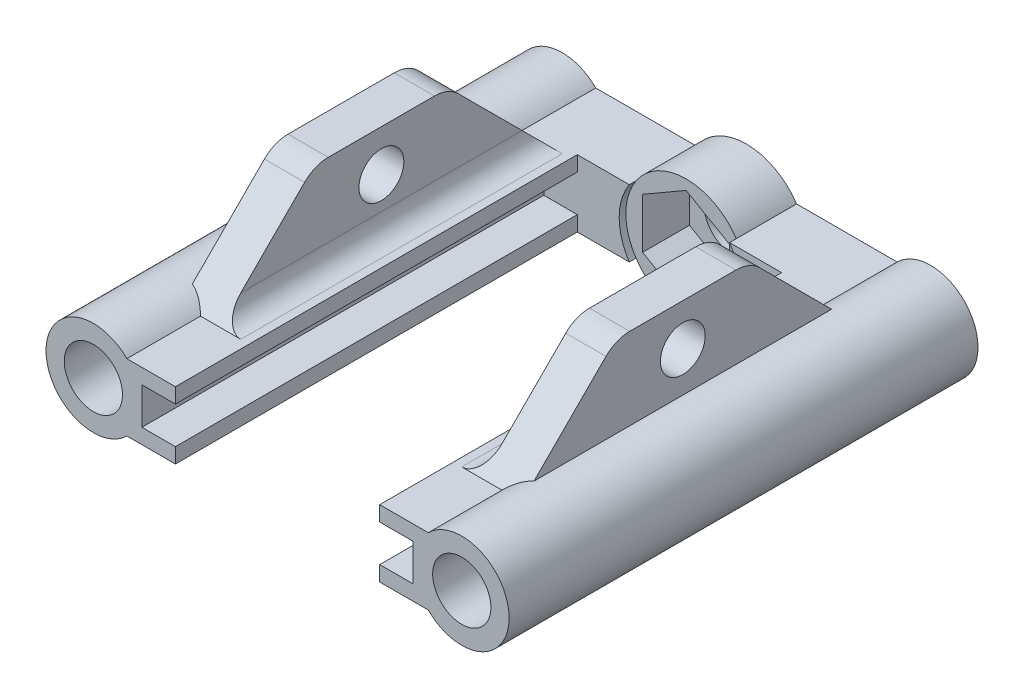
ISO-10303-21;
HEADER;
FILE_DESCRIPTION(('STEP AP214'),'2;1');
FILE_NAME('part.step','',(''),(''),'','','');
FILE_SCHEMA(('AUTOMOTIVE_DESIGN { 1 0 10303 214 1 1 1 1 }'));
ENDSEC;
DATA;
#1=APPLICATION_CONTEXT('core data for automotive mechanical design processes');
#2=APPLICATION_PROTOCOL_DEFINITION('international standard','automotive_design',2000,#1);
#3=PRODUCT_CONTEXT('',#1,'mechanical');
#4=PRODUCT('Part','Part','',(#3));
#5=PRODUCT_RELATED_PRODUCT_CATEGORY('part','',(#4));
#6=PRODUCT_DEFINITION_FORMATION('','',#4);
#7=PRODUCT_DEFINITION_CONTEXT('part definition',#1,'design');
#8=PRODUCT_DEFINITION('design','',#6,#7);
#9=PRODUCT_DEFINITION_SHAPE('','',#8);
#10=(LENGTH_UNIT() NAMED_UNIT(*) SI_UNIT(.MILLI.,.METRE.));
#11=(NAMED_UNIT(*) PLANE_ANGLE_UNIT() SI_UNIT($,.RADIAN.));
#12=(NAMED_UNIT(*) SI_UNIT($,.STERADIAN.) SOLID_ANGLE_UNIT());
#13=UNCERTAINTY_MEASURE_WITH_UNIT(LENGTH_MEASURE(1.E-05),#10,'distance_accuracy_value','');
#14=(GEOMETRIC_REPRESENTATION_CONTEXT(3) GLOBAL_UNCERTAINTY_ASSIGNED_CONTEXT((#13)) GLOBAL_UNIT_ASSIGNED_CONTEXT((#10,
#11,#12)) REPRESENTATION_CONTEXT('',''));
#15=CARTESIAN_POINT('',(0.,0.,0.));
#16=DIRECTION('',(0.,0.,1.));
#17=DIRECTION('',(1.,0.,0.));
#18=AXIS2_PLACEMENT_3D('',#15,#16,#17);
#19=CARTESIAN_POINT('',(-22.5,5.,10.));
#20=DIRECTION('',(0.,-1.,0.));
#21=DIRECTION('',(0.,0.,-1.));
#22=AXIS2_PLACEMENT_3D('',#19,#20,#21);
#23=PLANE('',#22);
#24=DIRECTION('',(1.,0.,0.));
#25=VECTOR('',#24,1.);
#26=CARTESIAN_POINT('',(-19.5,5.,11.0000000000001));
#27=LINE('',#26,#25);
#28=CARTESIAN_POINT('',(-22.5,5.,11.0000000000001));
#29=VERTEX_POINT('',#28);
#30=CARTESIAN_POINT('',(-16.5,5.,11.0000000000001));
#31=VERTEX_POINT('',#30);
#32=EDGE_CURVE('E454',#29,#31,#27,.T.);
#33=ORIENTED_EDGE('',*,*,#32,.T.);
#34=DIRECTION('',(0.,0.,-1.));
#35=VECTOR('',#34,1.);
#36=CARTESIAN_POINT('',(-16.5,5.,58.9999999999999));
#37=LINE('',#36,#35);
#38=CARTESIAN_POINT('',(-16.5,5.,58.9999999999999));
#39=VERTEX_POINT('',#38);
#40=EDGE_CURVE('E535',#31,#39,#37,.F.);
#41=ORIENTED_EDGE('',*,*,#40,.T.);
#42=DIRECTION('',(-1.,0.,0.));
#43=VECTOR('',#42,1.);
#44=CARTESIAN_POINT('',(-22.5,5.,58.9999999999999));
#45=LINE('',#44,#43);
#46=CARTESIAN_POINT('',(-22.5,5.,58.9999999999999));
#47=VERTEX_POINT('',#46);
#48=EDGE_CURVE('E461',#39,#47,#45,.T.);
#49=ORIENTED_EDGE('',*,*,#48,.T.);
#50=DIRECTION('',(0.,0.,-1.));
#51=VECTOR('',#50,1.);
#52=CARTESIAN_POINT('',(-22.5,5.,10.));
#53=LINE('',#52,#51);
#54=CARTESIAN_POINT('',(-22.5,5.,70.));
#55=VERTEX_POINT('',#54);
#56=EDGE_CURVE('E563',#55,#47,#53,.T.);
#57=ORIENTED_EDGE('',*,*,#56,.F.);
#58=DIRECTION('',(-1.,0.,0.));
#59=VECTOR('',#58,1.);
#60=CARTESIAN_POINT('',(-22.5,5.,70.));
#61=LINE('',#60,#59);
#62=CARTESIAN_POINT('',(-15.25,5.,70.));
#63=VERTEX_POINT('',#62);
#64=EDGE_CURVE('E391',#63,#55,#61,.T.);
#65=ORIENTED_EDGE('',*,*,#64,.F.);
#66=DIRECTION('',(0.,0.,-1.));
#67=VECTOR('',#66,1.);
#68=CARTESIAN_POINT('',(-15.25,5.,70.));
#69=LINE('',#68,#67);
#70=CARTESIAN_POINT('',(-15.25,5.,10.));
#71=VERTEX_POINT('',#70);
#72=EDGE_CURVE('E407',#63,#71,#69,.T.);
#73=ORIENTED_EDGE('',*,*,#72,.T.);
#74=DIRECTION('',(-1.,0.,0.));
#75=VECTOR('',#74,1.);
#76=CARTESIAN_POINT('',(-22.5,5.,10.));
#77=LINE('',#76,#75);
#78=CARTESIAN_POINT('',(-7.48331477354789,5.,10.));
#79=VERTEX_POINT('',#78);
#80=EDGE_CURVE('E436',#79,#71,#77,.T.);
#81=ORIENTED_EDGE('',*,*,#80,.F.);
#82=DIRECTION('',(0.,0.,-1.));
#83=VECTOR('',#82,1.);
#84=CARTESIAN_POINT('',(-7.48331477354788,5.,35.4558441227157));
#85=LINE('',#84,#83);
#86=CARTESIAN_POINT('',(-7.48331477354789,5.,9.));
#87=VERTEX_POINT('',#86);
#88=EDGE_CURVE('E681',#87,#79,#85,.F.);
#89=ORIENTED_EDGE('',*,*,#88,.F.);
#90=CARTESIAN_POINT('',(-7.48331477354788,5.,0.));
#91=VERTEX_POINT('',#90);
#92=EDGE_CURVE('E361',#91,#87,#85,.F.);
#93=ORIENTED_EDGE('',*,*,#92,.F.);
#94=DIRECTION('',(-1.,0.,0.));
#95=VECTOR('',#94,1.);
#96=CARTESIAN_POINT('',(-22.5,5.,0.));
#97=LINE('',#96,#95);
#98=CARTESIAN_POINT('',(-22.5,5.,0.));
#99=VERTEX_POINT('',#98);
#100=EDGE_CURVE('E707',#91,#99,#97,.T.);
#101=ORIENTED_EDGE('',*,*,#100,.T.);
#102=EDGE_CURVE('E1273',#29,#99,#53,.T.);
#103=ORIENTED_EDGE('',*,*,#102,.F.);
#104=EDGE_LOOP('',(#33,#41,#49,#57,#65,#73,#81,#89,#93,#101,#103));
#105=FACE_BOUND('',#104,.T.);
#106=ADVANCED_FACE('F33',(#105),#23,.F.);
#107=CARTESIAN_POINT('',(-27.5,0.,88.5932965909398));
#108=DIRECTION('',(0.,0.,-1.));
#109=DIRECTION('',(-1.,0.,0.));
#110=AXIS2_PLACEMENT_3D('',#107,#108,#109);
#111=CYLINDRICAL_SURFACE('',#110,7.07106781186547);
#112=CARTESIAN_POINT('',(-27.5,0.,63.9999999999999));
#113=DIRECTION('',(0.,0.707106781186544,0.707106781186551));
#114=DIRECTION('',(0.,0.707106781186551,-0.707106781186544));
#115=AXIS2_PLACEMENT_3D('',#112,#113,#114);
#116=ELLIPSE('',#115,9.99999999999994,7.07106781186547);
#117=CARTESIAN_POINT('',(-25.5,6.78232998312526,57.2176700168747));
#118=VERTEX_POINT('',#117);
#119=EDGE_CURVE('E465',#47,#118,#116,.T.);
#120=ORIENTED_EDGE('',*,*,#119,.T.);
#121=DIRECTION('',(0.,0.,-1.));
#122=VECTOR('',#121,1.);
#123=CARTESIAN_POINT('',(-25.5,6.78232998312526,88.5932965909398));
#124=LINE('',#123,#122);
#125=CARTESIAN_POINT('',(-25.5,6.78232998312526,12.7823299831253));
#126=VERTEX_POINT('',#125);
#127=EDGE_CURVE('E452',#126,#118,#124,.F.);
#128=ORIENTED_EDGE('',*,*,#127,.F.);
#129=CARTESIAN_POINT('',(-27.5,0.,6.00000000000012));
#130=DIRECTION('',(0.,0.707106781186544,-0.707106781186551));
#131=DIRECTION('',(0.,-0.707106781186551,-0.707106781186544));
#132=AXIS2_PLACEMENT_3D('',#129,#130,#131);
#133=ELLIPSE('',#132,9.99999999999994,7.07106781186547);
#134=EDGE_CURVE('E463',#126,#29,#133,.T.);
#135=ORIENTED_EDGE('',*,*,#134,.T.);
#136=ORIENTED_EDGE('',*,*,#102,.T.);
#137=CARTESIAN_POINT('',(-27.5,0.,0.));
#138=DIRECTION('',(0.,0.,1.));
#139=DIRECTION('',(1.,0.,0.));
#140=AXIS2_PLACEMENT_3D('',#137,#138,#139);
#141=CIRCLE('',#140,7.07106781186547);
#142=CARTESIAN_POINT('',(-22.5,-5.,0.));
#143=VERTEX_POINT('',#142);
#144=EDGE_CURVE('E598',#99,#143,#141,.T.);
#145=ORIENTED_EDGE('',*,*,#144,.T.);
#146=DIRECTION('',(0.,0.,-1.));
#147=VECTOR('',#146,1.);
#148=CARTESIAN_POINT('',(-22.5,-5.,10.));
#149=LINE('',#148,#147);
#150=CARTESIAN_POINT('',(-22.5,-5.,70.));
#151=VERTEX_POINT('',#150);
#152=EDGE_CURVE('E336',#151,#143,#149,.T.);
#153=ORIENTED_EDGE('',*,*,#152,.F.);
#154=CARTESIAN_POINT('',(-27.5,0.,70.));
#155=DIRECTION('',(0.,0.,-1.));
#156=DIRECTION('',(-1.,0.,0.));
#157=AXIS2_PLACEMENT_3D('',#154,#155,#156);
#158=CIRCLE('',#157,7.07106781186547);
#159=EDGE_CURVE('E601',#151,#55,#158,.T.);
#160=ORIENTED_EDGE('',*,*,#159,.T.);
#161=ORIENTED_EDGE('',*,*,#56,.T.);
#162=EDGE_LOOP('',(#120,#128,#135,#136,#145,#153,#160,#161));
#163=FACE_BOUND('',#162,.T.);
#164=ADVANCED_FACE('F753',(#163),#111,.T.);
#165=DIRECTION('',(-1.,0.,0.));
#166=VECTOR('',#165,1.);
#167=CARTESIAN_POINT('',(19.5,5.,58.9999999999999));
#168=LINE('',#167,#166);
#169=CARTESIAN_POINT('',(22.5,5.,58.9999999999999));
#170=VERTEX_POINT('',#169);
#171=CARTESIAN_POINT('',(16.5,5.,58.9999999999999));
#172=VERTEX_POINT('',#171);
#173=EDGE_CURVE('E48',#170,#172,#168,.T.);
#174=ORIENTED_EDGE('',*,*,#173,.T.);
#175=DIRECTION('',(0.,0.,1.));
#176=VECTOR('',#175,1.);
#177=CARTESIAN_POINT('',(16.5,5.,11.0000000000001));
#178=LINE('',#177,#176);
#179=CARTESIAN_POINT('',(16.5,5.,11.0000000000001));
#180=VERTEX_POINT('',#179);
#181=EDGE_CURVE('E541',#172,#180,#178,.F.);
#182=ORIENTED_EDGE('',*,*,#181,.T.);
#183=DIRECTION('',(1.,0.,0.));
#184=VECTOR('',#183,1.);
#185=CARTESIAN_POINT('',(22.5,5.,11.0000000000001));
#186=LINE('',#185,#184);
#187=CARTESIAN_POINT('',(22.5,5.,11.));
#188=VERTEX_POINT('',#187);
#189=EDGE_CURVE('E55',#180,#188,#186,.T.);
#190=ORIENTED_EDGE('',*,*,#189,.T.);
#191=DIRECTION('',(0.,0.,-1.));
#192=VECTOR('',#191,1.);
#193=CARTESIAN_POINT('',(22.5,5.,10.));
#194=LINE('',#193,#192);
#195=CARTESIAN_POINT('',(22.5,5.,0.));
#196=VERTEX_POINT('',#195);
#197=EDGE_CURVE('E559',#188,#196,#194,.T.);
#198=ORIENTED_EDGE('',*,*,#197,.T.);
#199=CARTESIAN_POINT('',(7.48331477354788,5.,0.));
#200=VERTEX_POINT('',#199);
#201=EDGE_CURVE('E712',#196,#200,#97,.T.);
#202=ORIENTED_EDGE('',*,*,#201,.T.);
#203=DIRECTION('',(0.,0.,-1.));
#204=VECTOR('',#203,1.);
#205=CARTESIAN_POINT('',(7.48331477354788,5.,35.4558441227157));
#206=LINE('',#205,#204);
#207=CARTESIAN_POINT('',(7.48331477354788,5.,9.));
#208=VERTEX_POINT('',#207);
#209=EDGE_CURVE('E677',#208,#200,#206,.T.);
#210=ORIENTED_EDGE('',*,*,#209,.F.);
#211=CARTESIAN_POINT('',(7.48331477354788,5.,10.));
#212=VERTEX_POINT('',#211);
#213=EDGE_CURVE('E678',#212,#208,#206,.T.);
#214=ORIENTED_EDGE('',*,*,#213,.F.);
#215=CARTESIAN_POINT('',(15.25,5.,10.));
#216=VERTEX_POINT('',#215);
#217=EDGE_CURVE('E431',#216,#212,#77,.T.);
#218=ORIENTED_EDGE('',*,*,#217,.F.);
#219=DIRECTION('',(0.,0.,-1.));
#220=VECTOR('',#219,1.);
#221=CARTESIAN_POINT('',(15.25,5.,70.));
#222=LINE('',#221,#220);
#223=CARTESIAN_POINT('',(15.25,5.,70.));
#224=VERTEX_POINT('',#223);
#225=EDGE_CURVE('E379',#224,#216,#222,.T.);
#226=ORIENTED_EDGE('',*,*,#225,.F.);
#227=DIRECTION('',(-1.,0.,0.));
#228=VECTOR('',#227,1.);
#229=CARTESIAN_POINT('',(22.5,5.00000000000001,70.));
#230=LINE('',#229,#228);
#231=CARTESIAN_POINT('',(22.5,5.00000000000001,70.));
#232=VERTEX_POINT('',#231);
#233=EDGE_CURVE('E345',#232,#224,#230,.T.);
#234=ORIENTED_EDGE('',*,*,#233,.F.);
#235=EDGE_CURVE('E320',#232,#170,#194,.T.);
#236=ORIENTED_EDGE('',*,*,#235,.T.);
#237=EDGE_LOOP('',(#174,#182,#190,#198,#202,#210,#214,#218,#226,#234,#236));
#238=FACE_BOUND('',#237,.T.);
#239=ADVANCED_FACE('F556',(#238),#23,.F.);
#240=CARTESIAN_POINT('',(27.5,0.,88.5932965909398));
#241=DIRECTION('',(0.,0.,-1.));
#242=DIRECTION('',(-1.,0.,0.));
#243=AXIS2_PLACEMENT_3D('',#240,#241,#242);
#244=CYLINDRICAL_SURFACE('',#243,7.07106781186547);
#245=CARTESIAN_POINT('',(27.5,0.,6.0000000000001));
#246=DIRECTION('',(0.,0.707106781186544,-0.707106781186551));
#247=DIRECTION('',(0.,-0.707106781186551,-0.707106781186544));
#248=AXIS2_PLACEMENT_3D('',#245,#246,#247);
#249=ELLIPSE('',#248,9.99999999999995,7.07106781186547);
#250=CARTESIAN_POINT('',(25.5,6.78232998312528,12.7823299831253));
#251=VERTEX_POINT('',#250);
#252=EDGE_CURVE('E472',#188,#251,#249,.T.);
#253=ORIENTED_EDGE('',*,*,#252,.T.);
#254=DIRECTION('',(0.,0.,-1.));
#255=VECTOR('',#254,1.);
#256=CARTESIAN_POINT('',(25.5,6.78232998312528,88.5932965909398));
#257=LINE('',#256,#255);
#258=CARTESIAN_POINT('',(25.5,6.78232998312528,57.2176700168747));
#259=VERTEX_POINT('',#258);
#260=EDGE_CURVE('E450',#259,#251,#257,.T.);
#261=ORIENTED_EDGE('',*,*,#260,.F.);
#262=CARTESIAN_POINT('',(27.5,0.,63.9999999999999));
#263=DIRECTION('',(0.,0.707106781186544,0.707106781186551));
#264=DIRECTION('',(0.,0.707106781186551,-0.707106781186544));
#265=AXIS2_PLACEMENT_3D('',#262,#263,#264);
#266=ELLIPSE('',#265,9.99999999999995,7.07106781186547);
#267=EDGE_CURVE('E470',#259,#170,#266,.T.);
#268=ORIENTED_EDGE('',*,*,#267,.T.);
#269=ORIENTED_EDGE('',*,*,#235,.F.);
#270=CARTESIAN_POINT('',(27.5,0.,70.));
#271=DIRECTION('',(0.,0.,-1.));
#272=DIRECTION('',(-1.,0.,0.));
#273=AXIS2_PLACEMENT_3D('',#270,#271,#272);
#274=CIRCLE('',#273,7.07106781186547);
#275=CARTESIAN_POINT('',(22.5,-5.,70.));
#276=VERTEX_POINT('',#275);
#277=EDGE_CURVE('E313',#232,#276,#274,.T.);
#278=ORIENTED_EDGE('',*,*,#277,.T.);
#279=DIRECTION('',(0.,0.,-1.));
#280=VECTOR('',#279,1.);
#281=CARTESIAN_POINT('',(22.5,-5.,10.));
#282=LINE('',#281,#280);
#283=CARTESIAN_POINT('',(22.5,-5.,0.));
#284=VERTEX_POINT('',#283);
#285=EDGE_CURVE('E318',#276,#284,#282,.T.);
#286=ORIENTED_EDGE('',*,*,#285,.T.);
#287=CARTESIAN_POINT('',(27.5,0.,0.));
#288=DIRECTION('',(0.,0.,1.));
#289=DIRECTION('',(-1.,0.,0.));
#290=AXIS2_PLACEMENT_3D('',#287,#288,#289);
#291=CIRCLE('',#290,7.07106781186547);
#292=EDGE_CURVE('E324',#284,#196,#291,.T.);
#293=ORIENTED_EDGE('',*,*,#292,.T.);
#294=ORIENTED_EDGE('',*,*,#197,.F.);
#295=EDGE_LOOP('',(#253,#261,#268,#269,#278,#286,#293,#294));
#296=FACE_BOUND('',#295,.T.);
#297=ADVANCED_FACE('F316',(#296),#244,.T.);
#298=CARTESIAN_POINT('',(0.,0.,10.));
#299=DIRECTION('',(0.,0.,-1.));
#300=DIRECTION('',(-1.,0.,0.));
#301=AXIS2_PLACEMENT_3D('',#298,#299,#300);
#302=PLANE('',#301);
#303=ORIENTED_EDGE('',*,*,#217,.T.);
#304=CARTESIAN_POINT('',(0.,0.,10.));
#305=DIRECTION('',(0.,0.,1.));
#306=DIRECTION('',(1.,0.,0.));
#307=AXIS2_PLACEMENT_3D('',#304,#305,#306);
#308=CIRCLE('',#307,9.);
#309=CARTESIAN_POINT('',(7.48331477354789,-5.,10.));
#310=VERTEX_POINT('',#309);
#311=EDGE_CURVE('E607',#310,#212,#308,.T.);
#312=ORIENTED_EDGE('',*,*,#311,.F.);
#313=DIRECTION('',(1.,0.,0.));
#314=VECTOR('',#313,1.);
#315=CARTESIAN_POINT('',(-22.5,-5.,10.));
#316=LINE('',#315,#314);
#317=CARTESIAN_POINT('',(15.25,-5.,10.));
#318=VERTEX_POINT('',#317);
#319=EDGE_CURVE('E435',#310,#318,#316,.T.);
#320=ORIENTED_EDGE('',*,*,#319,.T.);
#321=DIRECTION('',(0.,-1.,0.));
#322=VECTOR('',#321,1.);
#323=CARTESIAN_POINT('',(15.25,-2.75,10.));
#324=LINE('',#323,#322);
#325=CARTESIAN_POINT('',(15.25,-2.75,10.));
#326=VERTEX_POINT('',#325);
#327=EDGE_CURVE('E364',#326,#318,#324,.T.);
#328=ORIENTED_EDGE('',*,*,#327,.F.);
#329=DIRECTION('',(-1.,0.,0.));
#330=VECTOR('',#329,1.);
#331=CARTESIAN_POINT('',(20.25,-2.75,10.));
#332=LINE('',#331,#330);
#333=CARTESIAN_POINT('',(20.25,-2.75,10.));
#334=VERTEX_POINT('',#333);
#335=EDGE_CURVE('E360',#334,#326,#332,.T.);
#336=ORIENTED_EDGE('',*,*,#335,.F.);
#337=DIRECTION('',(0.,-1.,0.));
#338=VECTOR('',#337,1.);
#339=CARTESIAN_POINT('',(20.25,2.75,10.));
#340=LINE('',#339,#338);
#341=CARTESIAN_POINT('',(20.25,2.75,10.));
#342=VERTEX_POINT('',#341);
#343=EDGE_CURVE('E357',#342,#334,#340,.T.);
#344=ORIENTED_EDGE('',*,*,#343,.F.);
#345=DIRECTION('',(1.,0.,0.));
#346=VECTOR('',#345,1.);
#347=CARTESIAN_POINT('',(15.25,2.75,10.));
#348=LINE('',#347,#346);
#349=CARTESIAN_POINT('',(15.25,2.75,10.));
#350=VERTEX_POINT('',#349);
#351=EDGE_CURVE('E370',#350,#342,#348,.T.);
#352=ORIENTED_EDGE('',*,*,#351,.F.);
#353=DIRECTION('',(0.,-1.,0.));
#354=VECTOR('',#353,1.);
#355=CARTESIAN_POINT('',(15.25,5.,10.));
#356=LINE('',#355,#354);
#357=EDGE_CURVE('E367',#216,#350,#356,.T.);
#358=ORIENTED_EDGE('',*,*,#357,.F.);
#359=EDGE_LOOP('',(#303,#312,#320,#328,#336,#344,#352,#358));
#360=FACE_BOUND('',#359,.T.);
#361=ADVANCED_FACE('F767',(#360),#302,.F.);
#362=CARTESIAN_POINT('',(0.,0.,35.4558441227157));
#363=DIRECTION('',(0.,0.,-1.));
#364=DIRECTION('',(-1.,0.,0.));
#365=AXIS2_PLACEMENT_3D('',#362,#363,#364);
#366=CYLINDRICAL_SURFACE('',#365,9.);
#367=CARTESIAN_POINT('',(0.,0.,9.));
#368=DIRECTION('',(0.,0.,1.));
#369=DIRECTION('',(1.,0.,0.));
#370=AXIS2_PLACEMENT_3D('',#367,#368,#369);
#371=CIRCLE('',#370,9.);
#372=CARTESIAN_POINT('',(-7.48331477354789,-5.,9.));
#373=VERTEX_POINT('',#372);
#374=CARTESIAN_POINT('',(7.48331477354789,-5.,9.));
#375=VERTEX_POINT('',#374);
#376=EDGE_CURVE('E1288',#373,#375,#371,.T.);
#377=ORIENTED_EDGE('',*,*,#376,.F.);
#378=DIRECTION('',(0.,0.,-1.));
#379=VECTOR('',#378,1.);
#380=CARTESIAN_POINT('',(-7.48331477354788,-5.,35.4558441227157));
#381=LINE('',#380,#379);
#382=CARTESIAN_POINT('',(-7.48331477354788,-5.,0.));
#383=VERTEX_POINT('',#382);
#384=EDGE_CURVE('E670',#373,#383,#381,.T.);
#385=ORIENTED_EDGE('',*,*,#384,.T.);
#386=CARTESIAN_POINT('',(0.,0.,0.));
#387=DIRECTION('',(0.,0.,1.));
#388=DIRECTION('',(1.,0.,0.));
#389=AXIS2_PLACEMENT_3D('',#386,#387,#388);
#390=CIRCLE('',#389,9.);
#391=CARTESIAN_POINT('',(7.48331477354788,-5.,0.));
#392=VERTEX_POINT('',#391);
#393=EDGE_CURVE('E653',#383,#392,#390,.T.);
#394=ORIENTED_EDGE('',*,*,#393,.T.);
#395=DIRECTION('',(0.,0.,-1.));
#396=VECTOR('',#395,1.);
#397=CARTESIAN_POINT('',(7.48331477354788,-5.,35.4558441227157));
#398=LINE('',#397,#396);
#399=EDGE_CURVE('E674',#392,#375,#398,.F.);
#400=ORIENTED_EDGE('',*,*,#399,.T.);
#401=EDGE_LOOP('',(#377,#385,#394,#400));
#402=FACE_BOUND('',#401,.T.);
#403=ADVANCED_FACE('F772',(#402),#366,.T.);
#404=EDGE_CURVE('E608',#208,#87,#371,.T.);
#405=ORIENTED_EDGE('',*,*,#404,.F.);
#406=ORIENTED_EDGE('',*,*,#209,.T.);
#407=EDGE_CURVE('E668',#200,#91,#390,.T.);
#408=ORIENTED_EDGE('',*,*,#407,.T.);
#409=ORIENTED_EDGE('',*,*,#92,.T.);
#410=EDGE_LOOP('',(#405,#406,#408,#409));
#411=FACE_BOUND('',#410,.T.);
#412=ADVANCED_FACE('F824',(#411),#366,.T.);
#413=CARTESIAN_POINT('',(6.5,-3.75277674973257,2.));
#414=DIRECTION('',(1.,0.,0.));
#415=DIRECTION('',(0.,1.,0.));
#416=AXIS2_PLACEMENT_3D('',#413,#414,#415);
#417=PLANE('',#416);
#418=DIRECTION('',(0.,-1.,0.));
#419=VECTOR('',#418,1.);
#420=CARTESIAN_POINT('',(6.5,-3.75277674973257,9.));
#421=LINE('',#420,#419);
#422=CARTESIAN_POINT('',(6.5,3.75277674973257,9.));
#423=VERTEX_POINT('',#422);
#424=CARTESIAN_POINT('',(6.5,-3.75277674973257,9.));
#425=VERTEX_POINT('',#424);
#426=EDGE_CURVE('E623',#423,#425,#421,.T.);
#427=ORIENTED_EDGE('',*,*,#426,.F.);
#428=DIRECTION('',(0.,0.,1.));
#429=VECTOR('',#428,1.);
#430=CARTESIAN_POINT('',(6.5,3.75277674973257,2.));
#431=LINE('',#430,#429);
#432=CARTESIAN_POINT('',(6.5,3.75277674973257,2.));
#433=VERTEX_POINT('',#432);
#434=EDGE_CURVE('E649',#433,#423,#431,.T.);
#435=ORIENTED_EDGE('',*,*,#434,.F.);
#436=DIRECTION('',(0.,1.,0.));
#437=VECTOR('',#436,1.);
#438=CARTESIAN_POINT('',(6.5,-3.75277674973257,2.));
#439=LINE('',#438,#437);
#440=CARTESIAN_POINT('',(6.5,-3.75277674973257,2.));
#441=VERTEX_POINT('',#440);
#442=EDGE_CURVE('E629',#441,#433,#439,.T.);
#443=ORIENTED_EDGE('',*,*,#442,.F.);
#444=DIRECTION('',(0.,0.,1.));
#445=VECTOR('',#444,1.);
#446=CARTESIAN_POINT('',(6.5,-3.75277674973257,2.));
#447=LINE('',#446,#445);
#448=EDGE_CURVE('E650',#441,#425,#447,.T.);
#449=ORIENTED_EDGE('',*,*,#448,.T.);
#450=EDGE_LOOP('',(#427,#435,#443,#449));
#451=FACE_BOUND('',#450,.T.);
#452=ADVANCED_FACE('F805',(#451),#417,.F.);
#453=CARTESIAN_POINT('',(0.,-7.50555349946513,2.));
#454=DIRECTION('',(0.5,-0.866025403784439,0.));
#455=DIRECTION('',(0.866025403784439,0.5,0.));
#456=AXIS2_PLACEMENT_3D('',#453,#454,#455);
#457=PLANE('',#456);
#458=DIRECTION('',(-0.866025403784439,-0.5,0.));
#459=VECTOR('',#458,1.);
#460=CARTESIAN_POINT('',(0.,-7.50555349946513,9.));
#461=LINE('',#460,#459);
#462=CARTESIAN_POINT('',(0.,-7.50555349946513,9.));
#463=VERTEX_POINT('',#462);
#464=EDGE_CURVE('E621',#425,#463,#461,.T.);
#465=ORIENTED_EDGE('',*,*,#464,.F.);
#466=ORIENTED_EDGE('',*,*,#448,.F.);
#467=DIRECTION('',(0.866025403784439,0.5,0.));
#468=VECTOR('',#467,1.);
#469=CARTESIAN_POINT('',(0.,-7.50555349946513,2.));
#470=LINE('',#469,#468);
#471=CARTESIAN_POINT('',(0.,-7.50555349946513,2.));
#472=VERTEX_POINT('',#471);
#473=EDGE_CURVE('E646',#472,#441,#470,.T.);
#474=ORIENTED_EDGE('',*,*,#473,.F.);
#475=DIRECTION('',(0.,0.,1.));
#476=VECTOR('',#475,1.);
#477=CARTESIAN_POINT('',(0.,-7.50555349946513,2.));
#478=LINE('',#477,#476);
#479=EDGE_CURVE('E654',#472,#463,#478,.T.);
#480=ORIENTED_EDGE('',*,*,#479,.T.);
#481=EDGE_LOOP('',(#465,#466,#474,#480));
#482=FACE_BOUND('',#481,.T.);
#483=ADVANCED_FACE('F801',(#482),#457,.F.);
#484=CARTESIAN_POINT('',(-6.5,-3.75277674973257,2.));
#485=DIRECTION('',(-0.5,-0.866025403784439,0.));
#486=DIRECTION('',(0.866025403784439,-0.5,0.));
#487=AXIS2_PLACEMENT_3D('',#484,#485,#486);
#488=PLANE('',#487);
#489=DIRECTION('',(-0.866025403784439,0.5,0.));
#490=VECTOR('',#489,1.);
#491=CARTESIAN_POINT('',(-6.5,-3.75277674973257,9.));
#492=LINE('',#491,#490);
#493=CARTESIAN_POINT('',(-6.5,-3.75277674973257,9.));
#494=VERTEX_POINT('',#493);
#495=EDGE_CURVE('E619',#463,#494,#492,.T.);
#496=ORIENTED_EDGE('',*,*,#495,.F.);
#497=ORIENTED_EDGE('',*,*,#479,.F.);
#498=DIRECTION('',(0.866025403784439,-0.5,0.));
#499=VECTOR('',#498,1.);
#500=CARTESIAN_POINT('',(-6.5,-3.75277674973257,2.));
#501=LINE('',#500,#499);
#502=CARTESIAN_POINT('',(-6.5,-3.75277674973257,2.));
#503=VERTEX_POINT('',#502);
#504=EDGE_CURVE('E643',#503,#472,#501,.T.);
#505=ORIENTED_EDGE('',*,*,#504,.F.);
#506=DIRECTION('',(0.,0.,1.));
#507=VECTOR('',#506,1.);
#508=CARTESIAN_POINT('',(-6.5,-3.75277674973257,2.));
#509=LINE('',#508,#507);
#510=EDGE_CURVE('E657',#503,#494,#509,.T.);
#511=ORIENTED_EDGE('',*,*,#510,.T.);
#512=EDGE_LOOP('',(#496,#497,#505,#511));
#513=FACE_BOUND('',#512,.T.);
#514=ADVANCED_FACE('F804',(#513),#488,.F.);
#515=CARTESIAN_POINT('',(-6.5,3.75277674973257,2.));
#516=DIRECTION('',(-1.,0.,0.));
#517=DIRECTION('',(0.,0.,1.));
#518=AXIS2_PLACEMENT_3D('',#515,#516,#517);
#519=PLANE('',#518);
#520=DIRECTION('',(0.,1.,0.));
#521=VECTOR('',#520,1.);
#522=CARTESIAN_POINT('',(-6.5,3.75277674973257,9.));
#523=LINE('',#522,#521);
#524=CARTESIAN_POINT('',(-6.5,3.75277674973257,9.));
#525=VERTEX_POINT('',#524);
#526=EDGE_CURVE('E617',#494,#525,#523,.T.);
#527=ORIENTED_EDGE('',*,*,#526,.F.);
#528=ORIENTED_EDGE('',*,*,#510,.F.);
#529=DIRECTION('',(0.,-1.,0.));
#530=VECTOR('',#529,1.);
#531=CARTESIAN_POINT('',(-6.5,3.75277674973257,2.));
#532=LINE('',#531,#530);
#533=CARTESIAN_POINT('',(-6.5,3.75277674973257,2.));
#534=VERTEX_POINT('',#533);
#535=EDGE_CURVE('E640',#534,#503,#532,.T.);
#536=ORIENTED_EDGE('',*,*,#535,.F.);
#537=DIRECTION('',(0.,0.,1.));
#538=VECTOR('',#537,1.);
#539=CARTESIAN_POINT('',(-6.5,3.75277674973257,2.));
#540=LINE('',#539,#538);
#541=EDGE_CURVE('E660',#534,#525,#540,.T.);
#542=ORIENTED_EDGE('',*,*,#541,.T.);
#543=EDGE_LOOP('',(#527,#528,#536,#542));
#544=FACE_BOUND('',#543,.T.);
#545=ADVANCED_FACE('F809',(#544),#519,.F.);
#546=CARTESIAN_POINT('',(0.,7.50555349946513,2.));
#547=DIRECTION('',(-0.5,0.866025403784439,0.));
#548=DIRECTION('',(-0.866025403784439,-0.5,0.));
#549=AXIS2_PLACEMENT_3D('',#546,#547,#548);
#550=PLANE('',#549);
#551=DIRECTION('',(0.866025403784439,0.5,0.));
#552=VECTOR('',#551,1.);
#553=CARTESIAN_POINT('',(0.,7.50555349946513,9.));
#554=LINE('',#553,#552);
#555=CARTESIAN_POINT('',(0.,7.50555349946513,9.));
#556=VERTEX_POINT('',#555);
#557=EDGE_CURVE('E611',#525,#556,#554,.T.);
#558=ORIENTED_EDGE('',*,*,#557,.F.);
#559=ORIENTED_EDGE('',*,*,#541,.F.);
#560=DIRECTION('',(-0.866025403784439,-0.5,0.));
#561=VECTOR('',#560,1.);
#562=CARTESIAN_POINT('',(0.,7.50555349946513,2.));
#563=LINE('',#562,#561);
#564=CARTESIAN_POINT('',(0.,7.50555349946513,2.));
#565=VERTEX_POINT('',#564);
#566=EDGE_CURVE('E637',#565,#534,#563,.T.);
#567=ORIENTED_EDGE('',*,*,#566,.F.);
#568=DIRECTION('',(0.,0.,1.));
#569=VECTOR('',#568,1.);
#570=CARTESIAN_POINT('',(0.,7.50555349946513,2.));
#571=LINE('',#570,#569);
#572=EDGE_CURVE('E663',#565,#556,#571,.T.);
#573=ORIENTED_EDGE('',*,*,#572,.T.);
#574=EDGE_LOOP('',(#558,#559,#567,#573));
#575=FACE_BOUND('',#574,.T.);
#576=ADVANCED_FACE('F813',(#575),#550,.F.);
#577=CARTESIAN_POINT('',(6.5,3.75277674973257,2.));
#578=DIRECTION('',(0.5,0.866025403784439,0.));
#579=DIRECTION('',(-0.866025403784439,0.5,0.));
#580=AXIS2_PLACEMENT_3D('',#577,#578,#579);
#581=PLANE('',#580);
#582=DIRECTION('',(0.866025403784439,-0.5,0.));
#583=VECTOR('',#582,1.);
#584=CARTESIAN_POINT('',(6.5,3.75277674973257,9.));
#585=LINE('',#584,#583);
#586=EDGE_CURVE('E448',#556,#423,#585,.T.);
#587=ORIENTED_EDGE('',*,*,#586,.F.);
#588=ORIENTED_EDGE('',*,*,#572,.F.);
#589=DIRECTION('',(-0.866025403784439,0.5,0.));
#590=VECTOR('',#589,1.);
#591=CARTESIAN_POINT('',(6.5,3.75277674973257,2.));
#592=LINE('',#591,#590);
#593=EDGE_CURVE('E634',#433,#565,#592,.T.);
#594=ORIENTED_EDGE('',*,*,#593,.F.);
#595=ORIENTED_EDGE('',*,*,#434,.T.);
#596=EDGE_LOOP('',(#587,#588,#594,#595));
#597=FACE_BOUND('',#596,.T.);
#598=ADVANCED_FACE('F817',(#597),#581,.F.);
#599=CARTESIAN_POINT('',(-22.5,-5.,10.));
#600=DIRECTION('',(0.,1.,0.));
#601=DIRECTION('',(0.,0.,1.));
#602=AXIS2_PLACEMENT_3D('',#599,#600,#601);
#603=PLANE('',#602);
#604=ORIENTED_EDGE('',*,*,#399,.F.);
#605=DIRECTION('',(1.,0.,0.));
#606=VECTOR('',#605,1.);
#607=CARTESIAN_POINT('',(-22.5,-5.,0.));
#608=LINE('',#607,#606);
#609=EDGE_CURVE('E335',#392,#284,#608,.T.);
#610=ORIENTED_EDGE('',*,*,#609,.T.);
#611=ORIENTED_EDGE('',*,*,#285,.F.);
#612=DIRECTION('',(1.,0.,0.));
#613=VECTOR('',#612,1.);
#614=CARTESIAN_POINT('',(15.25,-5.,70.));
#615=LINE('',#614,#613);
#616=CARTESIAN_POINT('',(15.25,-5.,70.));
#617=VERTEX_POINT('',#616);
#618=EDGE_CURVE('E333',#617,#276,#615,.T.);
#619=ORIENTED_EDGE('',*,*,#618,.F.);
#620=DIRECTION('',(0.,0.,-1.));
#621=VECTOR('',#620,1.);
#622=CARTESIAN_POINT('',(15.25,-5.,70.));
#623=LINE('',#622,#621);
#624=EDGE_CURVE('E382',#617,#318,#623,.T.);
#625=ORIENTED_EDGE('',*,*,#624,.T.);
#626=ORIENTED_EDGE('',*,*,#319,.F.);
#627=EDGE_CURVE('E673',#375,#310,#398,.F.);
#628=ORIENTED_EDGE('',*,*,#627,.F.);
#629=EDGE_LOOP('',(#604,#610,#611,#619,#625,#626,#628));
#630=FACE_BOUND('',#629,.T.);
#631=ADVANCED_FACE('F331',(#630),#603,.F.);
#632=CARTESIAN_POINT('',(-7.48331477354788,-5.,10.));
#633=VERTEX_POINT('',#632);
#634=EDGE_CURVE('E671',#633,#373,#381,.T.);
#635=ORIENTED_EDGE('',*,*,#634,.F.);
#636=CARTESIAN_POINT('',(-15.25,-5.,10.));
#637=VERTEX_POINT('',#636);
#638=EDGE_CURVE('E337',#637,#633,#316,.T.);
#639=ORIENTED_EDGE('',*,*,#638,.F.);
#640=DIRECTION('',(0.,0.,-1.));
#641=VECTOR('',#640,1.);
#642=CARTESIAN_POINT('',(-15.25,-5.,70.));
#643=LINE('',#642,#641);
#644=CARTESIAN_POINT('',(-15.25,-5.,70.));
#645=VERTEX_POINT('',#644);
#646=EDGE_CURVE('E705',#645,#637,#643,.T.);
#647=ORIENTED_EDGE('',*,*,#646,.F.);
#648=DIRECTION('',(1.,0.,0.));
#649=VECTOR('',#648,1.);
#650=CARTESIAN_POINT('',(-15.25,-5.,70.));
#651=LINE('',#650,#649);
#652=EDGE_CURVE('E394',#151,#645,#651,.T.);
#653=ORIENTED_EDGE('',*,*,#652,.F.);
#654=ORIENTED_EDGE('',*,*,#152,.T.);
#655=EDGE_CURVE('E447',#143,#383,#608,.T.);
#656=ORIENTED_EDGE('',*,*,#655,.T.);
#657=ORIENTED_EDGE('',*,*,#384,.F.);
#658=EDGE_LOOP('',(#635,#639,#647,#653,#654,#656,#657));
#659=FACE_BOUND('',#658,.T.);
#660=ADVANCED_FACE('F1148',(#659),#603,.F.);
#661=ORIENTED_EDGE('',*,*,#638,.T.);
#662=EDGE_CURVE('E615',#79,#633,#308,.T.);
#663=ORIENTED_EDGE('',*,*,#662,.F.);
#664=ORIENTED_EDGE('',*,*,#80,.T.);
#665=DIRECTION('',(0.,1.,0.));
#666=VECTOR('',#665,1.);
#667=CARTESIAN_POINT('',(-15.25,5.,10.));
#668=LINE('',#667,#666);
#669=CARTESIAN_POINT('',(-15.25,2.75,10.));
#670=VERTEX_POINT('',#669);
#671=EDGE_CURVE('E395',#670,#71,#668,.T.);
#672=ORIENTED_EDGE('',*,*,#671,.F.);
#673=DIRECTION('',(1.,0.,0.));
#674=VECTOR('',#673,1.);
#675=CARTESIAN_POINT('',(-15.25,2.75,10.));
#676=LINE('',#675,#674);
#677=CARTESIAN_POINT('',(-20.25,2.75,10.));
#678=VERTEX_POINT('',#677);
#679=EDGE_CURVE('E414',#678,#670,#676,.T.);
#680=ORIENTED_EDGE('',*,*,#679,.F.);
#681=DIRECTION('',(0.,1.,0.));
#682=VECTOR('',#681,1.);
#683=CARTESIAN_POINT('',(-20.25,2.75,10.));
#684=LINE('',#683,#682);
#685=CARTESIAN_POINT('',(-20.25,-2.75,10.));
#686=VERTEX_POINT('',#685);
#687=EDGE_CURVE('E411',#686,#678,#684,.T.);
#688=ORIENTED_EDGE('',*,*,#687,.F.);
#689=DIRECTION('',(-1.,0.,0.));
#690=VECTOR('',#689,1.);
#691=CARTESIAN_POINT('',(-20.25,-2.75,10.));
#692=LINE('',#691,#690);
#693=CARTESIAN_POINT('',(-15.25,-2.75,10.));
#694=VERTEX_POINT('',#693);
#695=EDGE_CURVE('E408',#694,#686,#692,.T.);
#696=ORIENTED_EDGE('',*,*,#695,.F.);
#697=DIRECTION('',(0.,1.,0.));
#698=VECTOR('',#697,1.);
#699=CARTESIAN_POINT('',(-15.25,-2.75,10.));
#700=LINE('',#699,#698);
#701=EDGE_CURVE('E390',#637,#694,#700,.T.);
#702=ORIENTED_EDGE('',*,*,#701,.F.);
#703=EDGE_LOOP('',(#661,#663,#664,#672,#680,#688,#696,#702));
#704=FACE_BOUND('',#703,.T.);
#705=ADVANCED_FACE('F734',(#704),#302,.F.);
#706=CARTESIAN_POINT('',(0.,0.,0.));
#707=DIRECTION('',(0.,0.,-1.));
#708=DIRECTION('',(-1.,0.,0.));
#709=AXIS2_PLACEMENT_3D('',#706,#707,#708);
#710=PLANE('',#709);
#711=CARTESIAN_POINT('',(0.,0.,0.));
#712=DIRECTION('',(0.,0.,-1.));
#713=DIRECTION('',(-1.,0.,0.));
#714=AXIS2_PLACEMENT_3D('',#711,#712,#713);
#715=CIRCLE('',#714,4.35);
#716=CARTESIAN_POINT('',(-4.35,0.,0.));
#717=VERTEX_POINT('',#716);
#718=EDGE_CURVE('E625',#717,#717,#715,.F.);
#719=ORIENTED_EDGE('',*,*,#718,.T.);
#720=EDGE_LOOP('',(#719));
#721=FACE_BOUND('',#720,.T.);
#722=ORIENTED_EDGE('',*,*,#100,.F.);
#723=ORIENTED_EDGE('',*,*,#407,.F.);
#724=ORIENTED_EDGE('',*,*,#201,.F.);
#725=ORIENTED_EDGE('',*,*,#292,.F.);
#726=ORIENTED_EDGE('',*,*,#609,.F.);
#727=ORIENTED_EDGE('',*,*,#393,.F.);
#728=ORIENTED_EDGE('',*,*,#655,.F.);
#729=ORIENTED_EDGE('',*,*,#144,.F.);
#730=EDGE_LOOP('',(#722,#723,#724,#725,#726,#727,#728,#729));
#731=FACE_BOUND('',#730,.T.);
#732=CARTESIAN_POINT('',(-27.5,0.,0.));
#733=DIRECTION('',(0.,0.,1.));
#734=DIRECTION('',(1.,0.,0.));
#735=AXIS2_PLACEMENT_3D('',#732,#733,#734);
#736=CIRCLE('',#735,4.35);
#737=CARTESIAN_POINT('',(-23.15,0.,0.));
#738=VERTEX_POINT('',#737);
#739=EDGE_CURVE('E597',#738,#738,#736,.T.);
#740=ORIENTED_EDGE('',*,*,#739,.T.);
#741=EDGE_LOOP('',(#740));
#742=FACE_BOUND('',#741,.T.);
#743=CARTESIAN_POINT('',(27.5,0.,0.));
#744=DIRECTION('',(0.,0.,1.));
#745=DIRECTION('',(-1.,0.,0.));
#746=AXIS2_PLACEMENT_3D('',#743,#744,#745);
#747=CIRCLE('',#746,4.35);
#748=CARTESIAN_POINT('',(23.15,0.,0.));
#749=VERTEX_POINT('',#748);
#750=EDGE_CURVE('E325',#749,#749,#747,.T.);
#751=ORIENTED_EDGE('',*,*,#750,.T.);
#752=EDGE_LOOP('',(#751));
#753=FACE_BOUND('',#752,.T.);
#754=ADVANCED_FACE('F742',(#721,#731,#742,#753),#710,.T.);
#755=CARTESIAN_POINT('',(-15.25,-2.75,70.));
#756=DIRECTION('',(-1.,0.,0.));
#757=DIRECTION('',(0.,0.,1.));
#758=AXIS2_PLACEMENT_3D('',#755,#756,#757);
#759=PLANE('',#758);
#760=ORIENTED_EDGE('',*,*,#701,.T.);
#761=DIRECTION('',(0.,0.,-1.));
#762=VECTOR('',#761,1.);
#763=CARTESIAN_POINT('',(-15.25,-2.75,70.));
#764=LINE('',#763,#762);
#765=CARTESIAN_POINT('',(-15.25,-2.75,70.));
#766=VERTEX_POINT('',#765);
#767=EDGE_CURVE('E441',#766,#694,#764,.T.);
#768=ORIENTED_EDGE('',*,*,#767,.F.);
#769=DIRECTION('',(0.,1.,0.));
#770=VECTOR('',#769,1.);
#771=CARTESIAN_POINT('',(-15.25,-2.75,70.));
#772=LINE('',#771,#770);
#773=EDGE_CURVE('E397',#645,#766,#772,.T.);
#774=ORIENTED_EDGE('',*,*,#773,.F.);
#775=ORIENTED_EDGE('',*,*,#646,.T.);
#776=EDGE_LOOP('',(#760,#768,#774,#775));
#777=FACE_BOUND('',#776,.T.);
#778=ADVANCED_FACE('F740',(#777),#759,.F.);
#779=CARTESIAN_POINT('',(-20.25,-2.75,70.));
#780=DIRECTION('',(0.,-1.,0.));
#781=DIRECTION('',(0.,0.,-1.));
#782=AXIS2_PLACEMENT_3D('',#779,#780,#781);
#783=PLANE('',#782);
#784=ORIENTED_EDGE('',*,*,#695,.T.);
#785=DIRECTION('',(0.,0.,-1.));
#786=VECTOR('',#785,1.);
#787=CARTESIAN_POINT('',(-20.25,-2.75,70.));
#788=LINE('',#787,#786);
#789=CARTESIAN_POINT('',(-20.25,-2.75,70.));
#790=VERTEX_POINT('',#789);
#791=EDGE_CURVE('E714',#790,#686,#788,.T.);
#792=ORIENTED_EDGE('',*,*,#791,.F.);
#793=DIRECTION('',(-1.,0.,0.));
#794=VECTOR('',#793,1.);
#795=CARTESIAN_POINT('',(-20.25,-2.75,70.));
#796=LINE('',#795,#794);
#797=EDGE_CURVE('E399',#766,#790,#796,.T.);
#798=ORIENTED_EDGE('',*,*,#797,.F.);
#799=ORIENTED_EDGE('',*,*,#767,.T.);
#800=EDGE_LOOP('',(#784,#792,#798,#799));
#801=FACE_BOUND('',#800,.T.);
#802=ADVANCED_FACE('F739',(#801),#783,.F.);
#803=CARTESIAN_POINT('',(-20.25,2.75,70.));
#804=DIRECTION('',(-1.,0.,0.));
#805=DIRECTION('',(0.,0.,1.));
#806=AXIS2_PLACEMENT_3D('',#803,#804,#805);
#807=PLANE('',#806);
#808=ORIENTED_EDGE('',*,*,#687,.T.);
#809=DIRECTION('',(0.,0.,-1.));
#810=VECTOR('',#809,1.);
#811=CARTESIAN_POINT('',(-20.25,2.75,70.));
#812=LINE('',#811,#810);
#813=CARTESIAN_POINT('',(-20.25,2.75,70.));
#814=VERTEX_POINT('',#813);
#815=EDGE_CURVE('E719',#814,#678,#812,.T.);
#816=ORIENTED_EDGE('',*,*,#815,.F.);
#817=DIRECTION('',(0.,1.,0.));
#818=VECTOR('',#817,1.);
#819=CARTESIAN_POINT('',(-20.25,2.75,70.));
#820=LINE('',#819,#818);
#821=EDGE_CURVE('E401',#790,#814,#820,.T.);
#822=ORIENTED_EDGE('',*,*,#821,.F.);
#823=ORIENTED_EDGE('',*,*,#791,.T.);
#824=EDGE_LOOP('',(#808,#816,#822,#823));
#825=FACE_BOUND('',#824,.T.);
#826=ADVANCED_FACE('F735',(#825),#807,.F.);
#827=CARTESIAN_POINT('',(-15.25,2.75,70.));
#828=DIRECTION('',(0.,1.,0.));
#829=DIRECTION('',(0.,0.,1.));
#830=AXIS2_PLACEMENT_3D('',#827,#828,#829);
#831=PLANE('',#830);
#832=ORIENTED_EDGE('',*,*,#679,.T.);
#833=DIRECTION('',(0.,0.,-1.));
#834=VECTOR('',#833,1.);
#835=CARTESIAN_POINT('',(-15.25,2.75,70.));
#836=LINE('',#835,#834);
#837=CARTESIAN_POINT('',(-15.25,2.75,70.));
#838=VERTEX_POINT('',#837);
#839=EDGE_CURVE('E419',#838,#670,#836,.T.);
#840=ORIENTED_EDGE('',*,*,#839,.F.);
#841=DIRECTION('',(1.,0.,0.));
#842=VECTOR('',#841,1.);
#843=CARTESIAN_POINT('',(-15.25,2.75,70.));
#844=LINE('',#843,#842);
#845=EDGE_CURVE('E403',#814,#838,#844,.T.);
#846=ORIENTED_EDGE('',*,*,#845,.F.);
#847=ORIENTED_EDGE('',*,*,#815,.T.);
#848=EDGE_LOOP('',(#832,#840,#846,#847));
#849=FACE_BOUND('',#848,.T.);
#850=ADVANCED_FACE('F733',(#849),#831,.F.);
#851=CARTESIAN_POINT('',(-15.25,5.,70.));
#852=DIRECTION('',(-1.,0.,0.));
#853=DIRECTION('',(0.,-1.,0.));
#854=AXIS2_PLACEMENT_3D('',#851,#852,#853);
#855=PLANE('',#854);
#856=ORIENTED_EDGE('',*,*,#671,.T.);
#857=ORIENTED_EDGE('',*,*,#72,.F.);
#858=DIRECTION('',(0.,1.,0.));
#859=VECTOR('',#858,1.);
#860=CARTESIAN_POINT('',(-15.25,5.,70.));
#861=LINE('',#860,#859);
#862=EDGE_CURVE('E405',#838,#63,#861,.T.);
#863=ORIENTED_EDGE('',*,*,#862,.F.);
#864=ORIENTED_EDGE('',*,*,#839,.T.);
#865=EDGE_LOOP('',(#856,#857,#863,#864));
#866=FACE_BOUND('',#865,.T.);
#867=ADVANCED_FACE('F731',(#866),#855,.F.);
#868=CARTESIAN_POINT('',(0.,0.,70.));
#869=DIRECTION('',(0.,0.,-1.));
#870=DIRECTION('',(-1.,0.,0.));
#871=AXIS2_PLACEMENT_3D('',#868,#869,#870);
#872=PLANE('',#871);
#873=ORIENTED_EDGE('',*,*,#64,.T.);
#874=ORIENTED_EDGE('',*,*,#159,.F.);
#875=ORIENTED_EDGE('',*,*,#652,.T.);
#876=ORIENTED_EDGE('',*,*,#773,.T.);
#877=ORIENTED_EDGE('',*,*,#797,.T.);
#878=ORIENTED_EDGE('',*,*,#821,.T.);
#879=ORIENTED_EDGE('',*,*,#845,.T.);
#880=ORIENTED_EDGE('',*,*,#862,.T.);
#881=EDGE_LOOP('',(#873,#874,#875,#876,#877,#878,#879,#880));
#882=FACE_BOUND('',#881,.T.);
#883=CARTESIAN_POINT('',(-27.5,0.,70.));
#884=DIRECTION('',(0.,0.,-1.));
#885=DIRECTION('',(-1.,0.,0.));
#886=AXIS2_PLACEMENT_3D('',#883,#884,#885);
#887=CIRCLE('',#886,4.35);
#888=CARTESIAN_POINT('',(-31.85,0.,70.));
#889=VERTEX_POINT('',#888);
#890=EDGE_CURVE('E600',#889,#889,#887,.T.);
#891=ORIENTED_EDGE('',*,*,#890,.T.);
#892=EDGE_LOOP('',(#891));
#893=FACE_BOUND('',#892,.T.);
#894=ADVANCED_FACE('F737',(#882,#893),#872,.F.);
#895=CARTESIAN_POINT('',(20.25,2.75,70.));
#896=DIRECTION('',(1.,0.,0.));
#897=DIRECTION('',(0.,0.,-1.));
#898=AXIS2_PLACEMENT_3D('',#895,#896,#897);
#899=PLANE('',#898);
#900=ORIENTED_EDGE('',*,*,#343,.T.);
#901=DIRECTION('',(0.,0.,-1.));
#902=VECTOR('',#901,1.);
#903=CARTESIAN_POINT('',(20.25,-2.75,70.));
#904=LINE('',#903,#902);
#905=CARTESIAN_POINT('',(20.25,-2.75,70.));
#906=VERTEX_POINT('',#905);
#907=EDGE_CURVE('E387',#906,#334,#904,.T.);
#908=ORIENTED_EDGE('',*,*,#907,.F.);
#909=DIRECTION('',(0.,-1.,0.));
#910=VECTOR('',#909,1.);
#911=CARTESIAN_POINT('',(20.25,2.75,70.));
#912=LINE('',#911,#910);
#913=CARTESIAN_POINT('',(20.25,2.75,70.));
#914=VERTEX_POINT('',#913);
#915=EDGE_CURVE('E373',#914,#906,#912,.T.);
#916=ORIENTED_EDGE('',*,*,#915,.F.);
#917=DIRECTION('',(0.,0.,-1.));
#918=VECTOR('',#917,1.);
#919=CARTESIAN_POINT('',(20.25,2.75,70.));
#920=LINE('',#919,#918);
#921=EDGE_CURVE('E356',#914,#342,#920,.T.);
#922=ORIENTED_EDGE('',*,*,#921,.T.);
#923=EDGE_LOOP('',(#900,#908,#916,#922));
#924=FACE_BOUND('',#923,.T.);
#925=ADVANCED_FACE('F843',(#924),#899,.F.);
#926=CARTESIAN_POINT('',(20.25,-2.75,70.));
#927=DIRECTION('',(0.,-1.,0.));
#928=DIRECTION('',(1.,0.,0.));
#929=AXIS2_PLACEMENT_3D('',#926,#927,#928);
#930=PLANE('',#929);
#931=ORIENTED_EDGE('',*,*,#335,.T.);
#932=DIRECTION('',(0.,0.,-1.));
#933=VECTOR('',#932,1.);
#934=CARTESIAN_POINT('',(15.25,-2.75,70.));
#935=LINE('',#934,#933);
#936=CARTESIAN_POINT('',(15.25,-2.75,70.));
#937=VERTEX_POINT('',#936);
#938=EDGE_CURVE('E384',#937,#326,#935,.T.);
#939=ORIENTED_EDGE('',*,*,#938,.F.);
#940=DIRECTION('',(-1.,0.,0.));
#941=VECTOR('',#940,1.);
#942=CARTESIAN_POINT('',(20.25,-2.75,70.));
#943=LINE('',#942,#941);
#944=EDGE_CURVE('E349',#906,#937,#943,.T.);
#945=ORIENTED_EDGE('',*,*,#944,.F.);
#946=ORIENTED_EDGE('',*,*,#907,.T.);
#947=EDGE_LOOP('',(#931,#939,#945,#946));
#948=FACE_BOUND('',#947,.T.);
#949=ADVANCED_FACE('F688',(#948),#930,.F.);
#950=CARTESIAN_POINT('',(15.25,-2.75,70.));
#951=DIRECTION('',(1.,0.,0.));
#952=DIRECTION('',(0.,1.,0.));
#953=AXIS2_PLACEMENT_3D('',#950,#951,#952);
#954=PLANE('',#953);
#955=ORIENTED_EDGE('',*,*,#327,.T.);
#956=ORIENTED_EDGE('',*,*,#624,.F.);
#957=DIRECTION('',(0.,-1.,0.));
#958=VECTOR('',#957,1.);
#959=CARTESIAN_POINT('',(15.25,-2.75,70.));
#960=LINE('',#959,#958);
#961=EDGE_CURVE('E343',#937,#617,#960,.T.);
#962=ORIENTED_EDGE('',*,*,#961,.F.);
#963=ORIENTED_EDGE('',*,*,#938,.T.);
#964=EDGE_LOOP('',(#955,#956,#962,#963));
#965=FACE_BOUND('',#964,.T.);
#966=ADVANCED_FACE('F690',(#965),#954,.F.);
#967=CARTESIAN_POINT('',(15.25,5.,70.));
#968=DIRECTION('',(1.,0.,0.));
#969=DIRECTION('',(0.,1.,0.));
#970=AXIS2_PLACEMENT_3D('',#967,#968,#969);
#971=PLANE('',#970);
#972=ORIENTED_EDGE('',*,*,#357,.T.);
#973=DIRECTION('',(0.,0.,-1.));
#974=VECTOR('',#973,1.);
#975=CARTESIAN_POINT('',(15.25,2.75,70.));
#976=LINE('',#975,#974);
#977=CARTESIAN_POINT('',(15.25,2.75,70.));
#978=VERTEX_POINT('',#977);
#979=EDGE_CURVE('E376',#978,#350,#976,.T.);
#980=ORIENTED_EDGE('',*,*,#979,.F.);
#981=DIRECTION('',(0.,-1.,0.));
#982=VECTOR('',#981,1.);
#983=CARTESIAN_POINT('',(15.25,5.,70.));
#984=LINE('',#983,#982);
#985=EDGE_CURVE('E347',#224,#978,#984,.T.);
#986=ORIENTED_EDGE('',*,*,#985,.F.);
#987=ORIENTED_EDGE('',*,*,#225,.T.);
#988=EDGE_LOOP('',(#972,#980,#986,#987));
#989=FACE_BOUND('',#988,.T.);
#990=ADVANCED_FACE('F834',(#989),#971,.F.);
#991=CARTESIAN_POINT('',(15.25,2.75,70.));
#992=DIRECTION('',(0.,1.,0.));
#993=DIRECTION('',(-1.,0.,0.));
#994=AXIS2_PLACEMENT_3D('',#991,#992,#993);
#995=PLANE('',#994);
#996=ORIENTED_EDGE('',*,*,#351,.T.);
#997=ORIENTED_EDGE('',*,*,#921,.F.);
#998=DIRECTION('',(1.,0.,0.));
#999=VECTOR('',#998,1.);
#1000=CARTESIAN_POINT('',(15.25,2.75,70.));
#1001=LINE('',#1000,#999);
#1002=EDGE_CURVE('E354',#978,#914,#1001,.T.);
#1003=ORIENTED_EDGE('',*,*,#1002,.F.);
#1004=ORIENTED_EDGE('',*,*,#979,.T.);
#1005=EDGE_LOOP('',(#996,#997,#1003,#1004));
#1006=FACE_BOUND('',#1005,.T.);
#1007=ADVANCED_FACE('F831',(#1006),#995,.F.);
#1008=CARTESIAN_POINT('',(0.,0.,70.));
#1009=DIRECTION('',(0.,0.,-1.));
#1010=DIRECTION('',(-1.,0.,0.));
#1011=AXIS2_PLACEMENT_3D('',#1008,#1009,#1010);
#1012=PLANE('',#1011);
#1013=ORIENTED_EDGE('',*,*,#915,.T.);
#1014=ORIENTED_EDGE('',*,*,#944,.T.);
#1015=ORIENTED_EDGE('',*,*,#961,.T.);
#1016=ORIENTED_EDGE('',*,*,#618,.T.);
#1017=ORIENTED_EDGE('',*,*,#277,.F.);
#1018=ORIENTED_EDGE('',*,*,#233,.T.);
#1019=ORIENTED_EDGE('',*,*,#985,.T.);
#1020=ORIENTED_EDGE('',*,*,#1002,.T.);
#1021=EDGE_LOOP('',(#1013,#1014,#1015,#1016,#1017,#1018,#1019,#1020));
#1022=FACE_BOUND('',#1021,.T.);
#1023=CARTESIAN_POINT('',(27.5,0.,70.));
#1024=DIRECTION('',(0.,0.,-1.));
#1025=DIRECTION('',(-1.,0.,0.));
#1026=AXIS2_PLACEMENT_3D('',#1023,#1024,#1025);
#1027=CIRCLE('',#1026,4.35);
#1028=CARTESIAN_POINT('',(23.15,0.,70.));
#1029=VERTEX_POINT('',#1028);
#1030=EDGE_CURVE('E593',#1029,#1029,#1027,.T.);
#1031=ORIENTED_EDGE('',*,*,#1030,.T.);
#1032=EDGE_LOOP('',(#1031));
#1033=FACE_BOUND('',#1032,.T.);
#1034=ADVANCED_FACE('F340',(#1022,#1033),#1012,.F.);
#1035=CARTESIAN_POINT('',(0.,0.,2.));
#1036=DIRECTION('',(0.,0.,1.));
#1037=DIRECTION('',(1.,0.,0.));
#1038=AXIS2_PLACEMENT_3D('',#1035,#1036,#1037);
#1039=PLANE('',#1038);
#1040=CARTESIAN_POINT('',(0.,0.,2.));
#1041=DIRECTION('',(0.,0.,1.));
#1042=DIRECTION('',(1.,0.,0.));
#1043=AXIS2_PLACEMENT_3D('',#1040,#1041,#1042);
#1044=CIRCLE('',#1043,4.35);
#1045=CARTESIAN_POINT('',(4.35,0.,2.));
#1046=VERTEX_POINT('',#1045);
#1047=EDGE_CURVE('E626',#1046,#1046,#1044,.T.);
#1048=ORIENTED_EDGE('',*,*,#1047,.F.);
#1049=EDGE_LOOP('',(#1048));
#1050=FACE_BOUND('',#1049,.T.);
#1051=ORIENTED_EDGE('',*,*,#442,.T.);
#1052=ORIENTED_EDGE('',*,*,#593,.T.);
#1053=ORIENTED_EDGE('',*,*,#566,.T.);
#1054=ORIENTED_EDGE('',*,*,#535,.T.);
#1055=ORIENTED_EDGE('',*,*,#504,.T.);
#1056=ORIENTED_EDGE('',*,*,#473,.T.);
#1057=EDGE_LOOP('',(#1051,#1052,#1053,#1054,#1055,#1056));
#1058=FACE_BOUND('',#1057,.T.);
#1059=ADVANCED_FACE('F796',(#1050,#1058),#1039,.T.);
#1060=CARTESIAN_POINT('',(0.,0.,-0.00100000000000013));
#1061=DIRECTION('',(0.,0.,1.));
#1062=DIRECTION('',(1.,0.,0.));
#1063=AXIS2_PLACEMENT_3D('',#1060,#1061,#1062);
#1064=CYLINDRICAL_SURFACE('',#1063,4.35);
#1065=ORIENTED_EDGE('',*,*,#718,.F.);
#1066=EDGE_LOOP('',(#1065));
#1067=FACE_BOUND('',#1066,.T.);
#1068=ORIENTED_EDGE('',*,*,#1047,.T.);
#1069=EDGE_LOOP('',(#1068));
#1070=FACE_BOUND('',#1069,.T.);
#1071=ADVANCED_FACE('F792',(#1067,#1070),#1064,.F.);
#1072=CARTESIAN_POINT('',(0.,0.,9.));
#1073=DIRECTION('',(0.,0.,1.));
#1074=DIRECTION('',(1.,0.,0.));
#1075=AXIS2_PLACEMENT_3D('',#1072,#1073,#1074);
#1076=CYLINDRICAL_SURFACE('',#1075,9.);
#1077=ORIENTED_EDGE('',*,*,#662,.T.);
#1078=ORIENTED_EDGE('',*,*,#634,.T.);
#1079=EDGE_CURVE('E612',#87,#373,#371,.T.);
#1080=ORIENTED_EDGE('',*,*,#1079,.F.);
#1081=ORIENTED_EDGE('',*,*,#88,.T.);
#1082=EDGE_LOOP('',(#1077,#1078,#1080,#1081));
#1083=FACE_BOUND('',#1082,.T.);
#1084=ADVANCED_FACE('F789',(#1083),#1076,.F.);
#1085=EDGE_CURVE('E613',#375,#208,#371,.T.);
#1086=ORIENTED_EDGE('',*,*,#1085,.F.);
#1087=ORIENTED_EDGE('',*,*,#627,.T.);
#1088=ORIENTED_EDGE('',*,*,#311,.T.);
#1089=ORIENTED_EDGE('',*,*,#213,.T.);
#1090=EDGE_LOOP('',(#1086,#1087,#1088,#1089));
#1091=FACE_BOUND('',#1090,.T.);
#1092=ADVANCED_FACE('F787',(#1091),#1076,.F.);
#1093=CARTESIAN_POINT('',(0.,0.,9.));
#1094=DIRECTION('',(0.,0.,1.));
#1095=DIRECTION('',(1.,0.,0.));
#1096=AXIS2_PLACEMENT_3D('',#1093,#1094,#1095);
#1097=PLANE('',#1096);
#1098=ORIENTED_EDGE('',*,*,#404,.T.);
#1099=ORIENTED_EDGE('',*,*,#1079,.T.);
#1100=ORIENTED_EDGE('',*,*,#376,.T.);
#1101=ORIENTED_EDGE('',*,*,#1085,.T.);
#1102=EDGE_LOOP('',(#1098,#1099,#1100,#1101));
#1103=FACE_BOUND('',#1102,.T.);
#1104=ORIENTED_EDGE('',*,*,#426,.T.);
#1105=ORIENTED_EDGE('',*,*,#464,.T.);
#1106=ORIENTED_EDGE('',*,*,#495,.T.);
#1107=ORIENTED_EDGE('',*,*,#526,.T.);
#1108=ORIENTED_EDGE('',*,*,#557,.T.);
#1109=ORIENTED_EDGE('',*,*,#586,.T.);
#1110=EDGE_LOOP('',(#1104,#1105,#1106,#1107,#1108,#1109));
#1111=FACE_BOUND('',#1110,.T.);
#1112=ADVANCED_FACE('F783',(#1103,#1111),#1097,.T.);
#1113=CARTESIAN_POINT('',(-27.5,0.,88.5932965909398));
#1114=DIRECTION('',(0.,0.,-1.));
#1115=DIRECTION('',(-1.,0.,0.));
#1116=AXIS2_PLACEMENT_3D('',#1113,#1114,#1115);
#1117=CYLINDRICAL_SURFACE('',#1116,4.35);
#1118=ORIENTED_EDGE('',*,*,#890,.F.);
#1119=EDGE_LOOP('',(#1118));
#1120=FACE_BOUND('',#1119,.T.);
#1121=ORIENTED_EDGE('',*,*,#739,.F.);
#1122=EDGE_LOOP('',(#1121));
#1123=FACE_BOUND('',#1122,.T.);
#1124=ADVANCED_FACE('F778',(#1120,#1123),#1117,.F.);
#1125=CARTESIAN_POINT('',(27.5,0.,88.5932965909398));
#1126=DIRECTION('',(0.,0.,-1.));
#1127=DIRECTION('',(-1.,0.,0.));
#1128=AXIS2_PLACEMENT_3D('',#1125,#1126,#1127);
#1129=CYLINDRICAL_SURFACE('',#1128,4.35);
#1130=ORIENTED_EDGE('',*,*,#1030,.F.);
#1131=EDGE_LOOP('',(#1130));
#1132=FACE_BOUND('',#1131,.T.);
#1133=ORIENTED_EDGE('',*,*,#750,.F.);
#1134=EDGE_LOOP('',(#1133));
#1135=FACE_BOUND('',#1134,.T.);
#1136=ADVANCED_FACE('F776',(#1132,#1135),#1129,.F.);
#1137=CARTESIAN_POINT('',(25.5,19.,45.));
#1138=DIRECTION('',(-1.,0.,0.));
#1139=DIRECTION('',(0.,0.,1.));
#1140=AXIS2_PLACEMENT_3D('',#1137,#1138,#1139);
#1141=PLANE('',#1140);
#1142=CARTESIAN_POINT('',(25.5,12.8,35.));
#1143=DIRECTION('',(-1.,0.,0.));
#1144=DIRECTION('',(0.,0.,1.));
#1145=AXIS2_PLACEMENT_3D('',#1142,#1143,#1144);
#1146=CIRCLE('',#1145,3.35);
#1147=CARTESIAN_POINT('',(25.5,12.8,38.35));
#1148=VERTEX_POINT('',#1147);
#1149=EDGE_CURVE('E1315',#1148,#1148,#1146,.T.);
#1150=ORIENTED_EDGE('',*,*,#1149,.T.);
#1151=EDGE_LOOP('',(#1150));
#1152=FACE_BOUND('',#1151,.T.);
#1153=DIRECTION('',(0.,0.,-1.));
#1154=VECTOR('',#1153,1.);
#1155=CARTESIAN_POINT('',(25.5,19.,45.));
#1156=LINE('',#1155,#1154);
#1157=CARTESIAN_POINT('',(25.5,19.,42.9289321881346));
#1158=VERTEX_POINT('',#1157);
#1159=CARTESIAN_POINT('',(25.5,19.,27.0710678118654));
#1160=VERTEX_POINT('',#1159);
#1161=EDGE_CURVE('E582',#1158,#1160,#1156,.T.);
#1162=ORIENTED_EDGE('',*,*,#1161,.F.);
#1163=CARTESIAN_POINT('',(25.5,14.,42.9289321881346));
#1164=DIRECTION('',(-1.,0.,0.));
#1165=DIRECTION('',(0.,0.,1.));
#1166=AXIS2_PLACEMENT_3D('',#1163,#1164,#1165);
#1167=CIRCLE('',#1166,5.);
#1168=CARTESIAN_POINT('',(25.5,17.5355339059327,46.4644660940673));
#1169=VERTEX_POINT('',#1168);
#1170=EDGE_CURVE('E502',#1158,#1169,#1167,.F.);
#1171=ORIENTED_EDGE('',*,*,#1170,.T.);
#1172=DIRECTION('',(0.,0.707106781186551,-0.707106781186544));
#1173=VECTOR('',#1172,1.);
#1174=CARTESIAN_POINT('',(25.5,19.,45.));
#1175=LINE('',#1174,#1173);
#1176=EDGE_CURVE('E490',#1169,#259,#1175,.F.);
#1177=ORIENTED_EDGE('',*,*,#1176,.T.);
#1178=ORIENTED_EDGE('',*,*,#260,.T.);
#1179=DIRECTION('',(0.,-0.707106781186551,-0.707106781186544));
#1180=VECTOR('',#1179,1.);
#1181=CARTESIAN_POINT('',(25.5,29.,34.9999999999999));
#1182=LINE('',#1181,#1180);
#1183=CARTESIAN_POINT('',(25.5,17.5355339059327,23.5355339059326));
#1184=VERTEX_POINT('',#1183);
#1185=EDGE_CURVE('E487',#251,#1184,#1182,.F.);
#1186=ORIENTED_EDGE('',*,*,#1185,.T.);
#1187=CARTESIAN_POINT('',(25.5,14.,27.0710678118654));
#1188=DIRECTION('',(-1.,0.,0.));
#1189=DIRECTION('',(0.,0.,1.));
#1190=AXIS2_PLACEMENT_3D('',#1187,#1188,#1189);
#1191=CIRCLE('',#1190,5.);
#1192=EDGE_CURVE('E500',#1184,#1160,#1191,.F.);
#1193=ORIENTED_EDGE('',*,*,#1192,.T.);
#1194=EDGE_LOOP('',(#1162,#1171,#1177,#1178,#1186,#1193));
#1195=FACE_BOUND('',#1194,.T.);
#1196=ADVANCED_FACE('F571',(#1152,#1195),#1141,.F.);
#1197=CARTESIAN_POINT('',(19.5,19.,45.));
#1198=DIRECTION('',(1.,0.,0.));
#1199=DIRECTION('',(0.,0.,-1.));
#1200=AXIS2_PLACEMENT_3D('',#1197,#1198,#1199);
#1201=PLANE('',#1200);
#1202=CARTESIAN_POINT('',(19.5,12.8,35.));
#1203=DIRECTION('',(1.,0.,0.));
#1204=DIRECTION('',(0.,0.,-1.));
#1205=AXIS2_PLACEMENT_3D('',#1202,#1203,#1204);
#1206=CIRCLE('',#1205,3.35);
#1207=CARTESIAN_POINT('',(19.5,12.8,31.65));
#1208=VERTEX_POINT('',#1207);
#1209=EDGE_CURVE('E458',#1208,#1208,#1206,.T.);
#1210=ORIENTED_EDGE('',*,*,#1209,.T.);
#1211=EDGE_LOOP('',(#1210));
#1212=FACE_BOUND('',#1211,.T.);
#1213=DIRECTION('',(0.,0.707106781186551,0.707106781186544));
#1214=VECTOR('',#1213,1.);
#1215=CARTESIAN_POINT('',(19.5,29.,34.9999999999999));
#1216=LINE('',#1215,#1214);
#1217=CARTESIAN_POINT('',(19.5,17.5355339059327,23.5355339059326));
#1218=VERTEX_POINT('',#1217);
#1219=CARTESIAN_POINT('',(19.5,8.,14.));
#1220=VERTEX_POINT('',#1219);
#1221=EDGE_CURVE('E484',#1218,#1220,#1216,.F.);
#1222=ORIENTED_EDGE('',*,*,#1221,.T.);
#1223=DIRECTION('',(0.,0.,1.));
#1224=VECTOR('',#1223,1.);
#1225=CARTESIAN_POINT('',(19.5,8.,58.9999999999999));
#1226=LINE('',#1225,#1224);
#1227=CARTESIAN_POINT('',(19.5,8.,56.));
#1228=VERTEX_POINT('',#1227);
#1229=EDGE_CURVE('E538',#1220,#1228,#1226,.T.);
#1230=ORIENTED_EDGE('',*,*,#1229,.T.);
#1231=DIRECTION('',(0.,-0.707106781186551,0.707106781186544));
#1232=VECTOR('',#1231,1.);
#1233=CARTESIAN_POINT('',(19.5,19.,45.));
#1234=LINE('',#1233,#1232);
#1235=CARTESIAN_POINT('',(19.5,17.5355339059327,46.4644660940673));
#1236=VERTEX_POINT('',#1235);
#1237=EDGE_CURVE('E492',#1228,#1236,#1234,.F.);
#1238=ORIENTED_EDGE('',*,*,#1237,.T.);
#1239=CARTESIAN_POINT('',(19.5,14.,42.9289321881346));
#1240=DIRECTION('',(1.,0.,0.));
#1241=DIRECTION('',(0.,0.,-1.));
#1242=AXIS2_PLACEMENT_3D('',#1239,#1240,#1241);
#1243=CIRCLE('',#1242,5.);
#1244=CARTESIAN_POINT('',(19.5,19.,42.9289321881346));
#1245=VERTEX_POINT('',#1244);
#1246=EDGE_CURVE('E509',#1236,#1245,#1243,.F.);
#1247=ORIENTED_EDGE('',*,*,#1246,.T.);
#1248=DIRECTION('',(0.,0.,1.));
#1249=VECTOR('',#1248,1.);
#1250=CARTESIAN_POINT('',(19.5,19.,45.));
#1251=LINE('',#1250,#1249);
#1252=CARTESIAN_POINT('',(19.5,19.,27.0710678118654));
#1253=VERTEX_POINT('',#1252);
#1254=EDGE_CURVE('E580',#1253,#1245,#1251,.T.);
#1255=ORIENTED_EDGE('',*,*,#1254,.F.);
#1256=CARTESIAN_POINT('',(19.5,14.,27.0710678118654));
#1257=DIRECTION('',(1.,0.,0.));
#1258=DIRECTION('',(0.,0.,-1.));
#1259=AXIS2_PLACEMENT_3D('',#1256,#1257,#1258);
#1260=CIRCLE('',#1259,5.);
#1261=EDGE_CURVE('E507',#1253,#1218,#1260,.F.);
#1262=ORIENTED_EDGE('',*,*,#1261,.T.);
#1263=EDGE_LOOP('',(#1222,#1230,#1238,#1247,#1255,#1262));
#1264=FACE_BOUND('',#1263,.T.);
#1265=ADVANCED_FACE('F584',(#1212,#1264),#1201,.F.);
#1266=CARTESIAN_POINT('',(0.,19.,0.));
#1267=DIRECTION('',(0.,-1.,0.));
#1268=DIRECTION('',(0.,0.,-1.));
#1269=AXIS2_PLACEMENT_3D('',#1266,#1267,#1268);
#1270=PLANE('',#1269);
#1271=ORIENTED_EDGE('',*,*,#1254,.T.);
#1272=DIRECTION('',(-1.,0.,0.));
#1273=VECTOR('',#1272,1.);
#1274=CARTESIAN_POINT('',(0.,19.,42.9289321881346));
#1275=LINE('',#1274,#1273);
#1276=EDGE_CURVE('E497',#1245,#1158,#1275,.F.);
#1277=ORIENTED_EDGE('',*,*,#1276,.T.);
#1278=ORIENTED_EDGE('',*,*,#1161,.T.);
#1279=DIRECTION('',(1.,0.,0.));
#1280=VECTOR('',#1279,1.);
#1281=CARTESIAN_POINT('',(0.,19.,27.0710678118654));
#1282=LINE('',#1281,#1280);
#1283=EDGE_CURVE('E494',#1160,#1253,#1282,.F.);
#1284=ORIENTED_EDGE('',*,*,#1283,.T.);
#1285=EDGE_LOOP('',(#1271,#1277,#1278,#1284));
#1286=FACE_BOUND('',#1285,.T.);
#1287=ADVANCED_FACE('F579',(#1286),#1270,.F.);
#1288=CARTESIAN_POINT('',(-25.5,19.,45.));
#1289=DIRECTION('',(1.,0.,0.));
#1290=DIRECTION('',(0.,0.,-1.));
#1291=AXIS2_PLACEMENT_3D('',#1288,#1289,#1290);
#1292=PLANE('',#1291);
#1293=CARTESIAN_POINT('',(-25.5,12.8,35.));
#1294=DIRECTION('',(-1.,0.,0.));
#1295=DIRECTION('',(0.,0.,1.));
#1296=AXIS2_PLACEMENT_3D('',#1293,#1294,#1295);
#1297=CIRCLE('',#1296,3.35);
#1298=CARTESIAN_POINT('',(-25.5,12.8,38.35));
#1299=VERTEX_POINT('',#1298);
#1300=EDGE_CURVE('E459',#1299,#1299,#1297,.T.);
#1301=ORIENTED_EDGE('',*,*,#1300,.F.);
#1302=EDGE_LOOP('',(#1301));
#1303=FACE_BOUND('',#1302,.T.);
#1304=DIRECTION('',(0.,0.,1.));
#1305=VECTOR('',#1304,1.);
#1306=CARTESIAN_POINT('',(-25.5,19.,45.));
#1307=LINE('',#1306,#1305);
#1308=CARTESIAN_POINT('',(-25.5,19.,27.0710678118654));
#1309=VERTEX_POINT('',#1308);
#1310=CARTESIAN_POINT('',(-25.5,19.,42.9289321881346));
#1311=VERTEX_POINT('',#1310);
#1312=EDGE_CURVE('E589',#1309,#1311,#1307,.T.);
#1313=ORIENTED_EDGE('',*,*,#1312,.F.);
#1314=CARTESIAN_POINT('',(-25.5,14.,27.0710678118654));
#1315=DIRECTION('',(1.,0.,0.));
#1316=DIRECTION('',(0.,0.,-1.));
#1317=AXIS2_PLACEMENT_3D('',#1314,#1315,#1316);
#1318=CIRCLE('',#1317,5.);
#1319=CARTESIAN_POINT('',(-25.5,17.5355339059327,23.5355339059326));
#1320=VERTEX_POINT('',#1319);
#1321=EDGE_CURVE('E521',#1309,#1320,#1318,.F.);
#1322=ORIENTED_EDGE('',*,*,#1321,.T.);
#1323=DIRECTION('',(0.,0.707106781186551,0.707106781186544));
#1324=VECTOR('',#1323,1.);
#1325=CARTESIAN_POINT('',(-25.5,29.,34.9999999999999));
#1326=LINE('',#1325,#1324);
#1327=EDGE_CURVE('E480',#1320,#126,#1326,.F.);
#1328=ORIENTED_EDGE('',*,*,#1327,.T.);
#1329=ORIENTED_EDGE('',*,*,#127,.T.);
#1330=DIRECTION('',(0.,-0.707106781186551,0.707106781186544));
#1331=VECTOR('',#1330,1.);
#1332=CARTESIAN_POINT('',(-25.5,19.,45.));
#1333=LINE('',#1332,#1331);
#1334=CARTESIAN_POINT('',(-25.5,17.5355339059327,46.4644660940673));
#1335=VERTEX_POINT('',#1334);
#1336=EDGE_CURVE('E477',#118,#1335,#1333,.F.);
#1337=ORIENTED_EDGE('',*,*,#1336,.T.);
#1338=CARTESIAN_POINT('',(-25.5,14.,42.9289321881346));
#1339=DIRECTION('',(1.,0.,0.));
#1340=DIRECTION('',(0.,0.,-1.));
#1341=AXIS2_PLACEMENT_3D('',#1338,#1339,#1340);
#1342=CIRCLE('',#1341,5.);
#1343=EDGE_CURVE('E519',#1335,#1311,#1342,.F.);
#1344=ORIENTED_EDGE('',*,*,#1343,.T.);
#1345=EDGE_LOOP('',(#1313,#1322,#1328,#1329,#1337,#1344));
#1346=FACE_BOUND('',#1345,.T.);
#1347=ADVANCED_FACE('F948',(#1303,#1346),#1292,.F.);
#1348=CARTESIAN_POINT('',(-19.5,19.,45.));
#1349=DIRECTION('',(-1.,0.,0.));
#1350=DIRECTION('',(0.,0.,1.));
#1351=AXIS2_PLACEMENT_3D('',#1348,#1349,#1350);
#1352=PLANE('',#1351);
#1353=CARTESIAN_POINT('',(-19.5,12.8,35.));
#1354=DIRECTION('',(-1.,0.,0.));
#1355=DIRECTION('',(0.,0.,1.));
#1356=AXIS2_PLACEMENT_3D('',#1353,#1354,#1355);
#1357=CIRCLE('',#1356,3.35);
#1358=CARTESIAN_POINT('',(-19.5,12.8,38.35));
#1359=VERTEX_POINT('',#1358);
#1360=EDGE_CURVE('E455',#1359,#1359,#1357,.T.);
#1361=ORIENTED_EDGE('',*,*,#1360,.T.);
#1362=EDGE_LOOP('',(#1361));
#1363=FACE_BOUND('',#1362,.T.);
#1364=DIRECTION('',(0.,0.707106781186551,-0.707106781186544));
#1365=VECTOR('',#1364,1.);
#1366=CARTESIAN_POINT('',(-19.5,19.,45.));
#1367=LINE('',#1366,#1365);
#1368=CARTESIAN_POINT('',(-19.5,17.5355339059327,46.4644660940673));
#1369=VERTEX_POINT('',#1368);
#1370=CARTESIAN_POINT('',(-19.5,8.,56.));
#1371=VERTEX_POINT('',#1370);
#1372=EDGE_CURVE('E474',#1369,#1371,#1367,.F.);
#1373=ORIENTED_EDGE('',*,*,#1372,.T.);
#1374=DIRECTION('',(0.,0.,-1.));
#1375=VECTOR('',#1374,1.);
#1376=CARTESIAN_POINT('',(-19.5,8.,11.0000000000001));
#1377=LINE('',#1376,#1375);
#1378=CARTESIAN_POINT('',(-19.5,8.,14.));
#1379=VERTEX_POINT('',#1378);
#1380=EDGE_CURVE('E532',#1371,#1379,#1377,.T.);
#1381=ORIENTED_EDGE('',*,*,#1380,.T.);
#1382=DIRECTION('',(0.,-0.707106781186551,-0.707106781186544));
#1383=VECTOR('',#1382,1.);
#1384=CARTESIAN_POINT('',(-19.5,29.,34.9999999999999));
#1385=LINE('',#1384,#1383);
#1386=CARTESIAN_POINT('',(-19.5,17.5355339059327,23.5355339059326));
#1387=VERTEX_POINT('',#1386);
#1388=EDGE_CURVE('E482',#1379,#1387,#1385,.F.);
#1389=ORIENTED_EDGE('',*,*,#1388,.T.);
#1390=CARTESIAN_POINT('',(-19.5,14.,27.0710678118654));
#1391=DIRECTION('',(-1.,0.,0.));
#1392=DIRECTION('',(0.,0.,1.));
#1393=AXIS2_PLACEMENT_3D('',#1390,#1391,#1392);
#1394=CIRCLE('',#1393,5.);
#1395=CARTESIAN_POINT('',(-19.5,19.,27.0710678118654));
#1396=VERTEX_POINT('',#1395);
#1397=EDGE_CURVE('E528',#1387,#1396,#1394,.F.);
#1398=ORIENTED_EDGE('',*,*,#1397,.T.);
#1399=DIRECTION('',(0.,0.,-1.));
#1400=VECTOR('',#1399,1.);
#1401=CARTESIAN_POINT('',(-19.5,19.,45.));
#1402=LINE('',#1401,#1400);
#1403=CARTESIAN_POINT('',(-19.5,19.,42.9289321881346));
#1404=VERTEX_POINT('',#1403);
#1405=EDGE_CURVE('E1314',#1404,#1396,#1402,.T.);
#1406=ORIENTED_EDGE('',*,*,#1405,.F.);
#1407=CARTESIAN_POINT('',(-19.5,14.,42.9289321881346));
#1408=DIRECTION('',(-1.,0.,0.));
#1409=DIRECTION('',(0.,0.,1.));
#1410=AXIS2_PLACEMENT_3D('',#1407,#1408,#1409);
#1411=CIRCLE('',#1410,5.);
#1412=EDGE_CURVE('E526',#1404,#1369,#1411,.F.);
#1413=ORIENTED_EDGE('',*,*,#1412,.T.);
#1414=EDGE_LOOP('',(#1373,#1381,#1389,#1398,#1406,#1413));
#1415=FACE_BOUND('',#1414,.T.);
#1416=ADVANCED_FACE('F955',(#1363,#1415),#1352,.F.);
#1417=CARTESIAN_POINT('',(0.,19.,0.));
#1418=DIRECTION('',(0.,1.,0.));
#1419=DIRECTION('',(0.,0.,1.));
#1420=AXIS2_PLACEMENT_3D('',#1417,#1418,#1419);
#1421=PLANE('',#1420);
#1422=ORIENTED_EDGE('',*,*,#1405,.T.);
#1423=DIRECTION('',(1.,0.,0.));
#1424=VECTOR('',#1423,1.);
#1425=CARTESIAN_POINT('',(-25.5,19.,27.0710678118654));
#1426=LINE('',#1425,#1424);
#1427=EDGE_CURVE('E516',#1396,#1309,#1426,.F.);
#1428=ORIENTED_EDGE('',*,*,#1427,.T.);
#1429=ORIENTED_EDGE('',*,*,#1312,.T.);
#1430=DIRECTION('',(-1.,0.,0.));
#1431=VECTOR('',#1430,1.);
#1432=CARTESIAN_POINT('',(-19.5,19.,42.9289321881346));
#1433=LINE('',#1432,#1431);
#1434=EDGE_CURVE('E513',#1311,#1404,#1433,.F.);
#1435=ORIENTED_EDGE('',*,*,#1434,.T.);
#1436=EDGE_LOOP('',(#1422,#1428,#1429,#1435));
#1437=FACE_BOUND('',#1436,.T.);
#1438=ADVANCED_FACE('F963',(#1437),#1421,.T.);
#1439=CARTESIAN_POINT('',(34.5710678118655,12.8,35.));
#1440=DIRECTION('',(-1.,0.,0.));
#1441=DIRECTION('',(0.,0.,1.));
#1442=AXIS2_PLACEMENT_3D('',#1439,#1440,#1441);
#1443=CYLINDRICAL_SURFACE('',#1442,3.35);
#1444=ORIENTED_EDGE('',*,*,#1300,.T.);
#1445=EDGE_LOOP('',(#1444));
#1446=FACE_BOUND('',#1445,.T.);
#1447=ORIENTED_EDGE('',*,*,#1360,.F.);
#1448=EDGE_LOOP('',(#1447));
#1449=FACE_BOUND('',#1448,.T.);
#1450=ADVANCED_FACE('F971',(#1446,#1449),#1443,.F.);
#1451=ORIENTED_EDGE('',*,*,#1209,.F.);
#1452=EDGE_LOOP('',(#1451));
#1453=FACE_BOUND('',#1452,.T.);
#1454=ORIENTED_EDGE('',*,*,#1149,.F.);
#1455=EDGE_LOOP('',(#1454));
#1456=FACE_BOUND('',#1455,.T.);
#1457=ADVANCED_FACE('F979',(#1453,#1456),#1443,.F.);
#1458=CARTESIAN_POINT('',(-19.5,19.0000000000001,45.));
#1459=DIRECTION('',(0.,0.707106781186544,0.707106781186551));
#1460=DIRECTION('',(-1.,0.,0.));
#1461=AXIS2_PLACEMENT_3D('',#1458,#1459,#1460);
#1462=PLANE('',#1461);
#1463=ORIENTED_EDGE('',*,*,#1372,.F.);
#1464=DIRECTION('',(1.,0.,0.));
#1465=VECTOR('',#1464,1.);
#1466=CARTESIAN_POINT('',(-25.5,17.5355339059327,46.4644660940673));
#1467=LINE('',#1466,#1465);
#1468=EDGE_CURVE('E530',#1369,#1335,#1467,.F.);
#1469=ORIENTED_EDGE('',*,*,#1468,.T.);
#1470=ORIENTED_EDGE('',*,*,#1336,.F.);
#1471=ORIENTED_EDGE('',*,*,#119,.F.);
#1472=ORIENTED_EDGE('',*,*,#48,.F.);
#1473=CARTESIAN_POINT('',(-16.5,8.,56.));
#1474=DIRECTION('',(0.,0.707106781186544,0.707106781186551));
#1475=DIRECTION('',(0.,-0.707106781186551,0.707106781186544));
#1476=AXIS2_PLACEMENT_3D('',#1473,#1474,#1475);
#1477=ELLIPSE('',#1476,4.24264068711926,3.);
#1478=EDGE_CURVE('E546',#39,#1371,#1477,.F.);
#1479=ORIENTED_EDGE('',*,*,#1478,.T.);
#1480=EDGE_LOOP('',(#1463,#1469,#1470,#1471,#1472,#1479));
#1481=FACE_BOUND('',#1480,.T.);
#1482=ADVANCED_FACE('F987',(#1481),#1462,.T.);
#1483=CARTESIAN_POINT('',(-19.5,19.0000000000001,25.));
#1484=DIRECTION('',(0.,0.707106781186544,-0.707106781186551));
#1485=DIRECTION('',(1.,0.,0.));
#1486=AXIS2_PLACEMENT_3D('',#1483,#1484,#1485);
#1487=PLANE('',#1486);
#1488=ORIENTED_EDGE('',*,*,#1327,.F.);
#1489=DIRECTION('',(-1.,0.,0.));
#1490=VECTOR('',#1489,1.);
#1491=CARTESIAN_POINT('',(-19.5,17.5355339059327,23.5355339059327));
#1492=LINE('',#1491,#1490);
#1493=EDGE_CURVE('E523',#1320,#1387,#1492,.F.);
#1494=ORIENTED_EDGE('',*,*,#1493,.T.);
#1495=ORIENTED_EDGE('',*,*,#1388,.F.);
#1496=CARTESIAN_POINT('',(-16.5,8.,14.));
#1497=DIRECTION('',(0.,0.707106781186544,-0.707106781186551));
#1498=DIRECTION('',(0.,0.707106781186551,0.707106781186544));
#1499=AXIS2_PLACEMENT_3D('',#1496,#1497,#1498);
#1500=ELLIPSE('',#1499,4.24264068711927,3.);
#1501=EDGE_CURVE('E543',#1379,#31,#1500,.F.);
#1502=ORIENTED_EDGE('',*,*,#1501,.T.);
#1503=ORIENTED_EDGE('',*,*,#32,.F.);
#1504=ORIENTED_EDGE('',*,*,#134,.F.);
#1505=EDGE_LOOP('',(#1488,#1494,#1495,#1502,#1503,#1504));
#1506=FACE_BOUND('',#1505,.T.);
#1507=ADVANCED_FACE('F994',(#1506),#1487,.T.);
#1508=CARTESIAN_POINT('',(19.5,19.0000000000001,25.));
#1509=DIRECTION('',(0.,0.707106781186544,-0.707106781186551));
#1510=DIRECTION('',(1.,0.,0.));
#1511=AXIS2_PLACEMENT_3D('',#1508,#1509,#1510);
#1512=PLANE('',#1511);
#1513=ORIENTED_EDGE('',*,*,#1221,.F.);
#1514=DIRECTION('',(-1.,0.,0.));
#1515=VECTOR('',#1514,1.);
#1516=CARTESIAN_POINT('',(19.5,17.5355339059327,23.5355339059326));
#1517=LINE('',#1516,#1515);
#1518=EDGE_CURVE('E511',#1218,#1184,#1517,.F.);
#1519=ORIENTED_EDGE('',*,*,#1518,.T.);
#1520=ORIENTED_EDGE('',*,*,#1185,.F.);
#1521=ORIENTED_EDGE('',*,*,#252,.F.);
#1522=ORIENTED_EDGE('',*,*,#189,.F.);
#1523=CARTESIAN_POINT('',(16.5,8.,14.));
#1524=DIRECTION('',(0.,0.707106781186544,-0.707106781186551));
#1525=DIRECTION('',(0.,-0.707106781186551,-0.707106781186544));
#1526=AXIS2_PLACEMENT_3D('',#1523,#1524,#1525);
#1527=ELLIPSE('',#1526,4.24264068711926,3.);
#1528=EDGE_CURVE('E11',#180,#1220,#1527,.F.);
#1529=ORIENTED_EDGE('',*,*,#1528,.T.);
#1530=EDGE_LOOP('',(#1513,#1519,#1520,#1521,#1522,#1529));
#1531=FACE_BOUND('',#1530,.T.);
#1532=ADVANCED_FACE('F566',(#1531),#1512,.T.);
#1533=CARTESIAN_POINT('',(19.5,19.0000000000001,45.));
#1534=DIRECTION('',(0.,0.707106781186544,0.707106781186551));
#1535=DIRECTION('',(-1.,0.,0.));
#1536=AXIS2_PLACEMENT_3D('',#1533,#1534,#1535);
#1537=PLANE('',#1536);
#1538=ORIENTED_EDGE('',*,*,#1176,.F.);
#1539=DIRECTION('',(1.,0.,0.));
#1540=VECTOR('',#1539,1.);
#1541=CARTESIAN_POINT('',(19.5,17.5355339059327,46.4644660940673));
#1542=LINE('',#1541,#1540);
#1543=EDGE_CURVE('E504',#1169,#1236,#1542,.F.);
#1544=ORIENTED_EDGE('',*,*,#1543,.T.);
#1545=ORIENTED_EDGE('',*,*,#1237,.F.);
#1546=CARTESIAN_POINT('',(16.5,8.,56.));
#1547=DIRECTION('',(0.,0.707106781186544,0.707106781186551));
#1548=DIRECTION('',(0.,0.707106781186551,-0.707106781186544));
#1549=AXIS2_PLACEMENT_3D('',#1546,#1547,#1548);
#1550=ELLIPSE('',#1549,4.24264068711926,3.);
#1551=EDGE_CURVE('E41',#1228,#172,#1550,.F.);
#1552=ORIENTED_EDGE('',*,*,#1551,.T.);
#1553=ORIENTED_EDGE('',*,*,#173,.F.);
#1554=ORIENTED_EDGE('',*,*,#267,.F.);
#1555=EDGE_LOOP('',(#1538,#1544,#1545,#1552,#1553,#1554));
#1556=FACE_BOUND('',#1555,.T.);
#1557=ADVANCED_FACE('F551',(#1556),#1537,.T.);
#1558=CARTESIAN_POINT('',(0.,14.,42.9289321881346));
#1559=DIRECTION('',(-1.,0.,0.));
#1560=DIRECTION('',(0.,0.,1.));
#1561=AXIS2_PLACEMENT_3D('',#1558,#1559,#1560);
#1562=CYLINDRICAL_SURFACE('',#1561,5.);
#1563=ORIENTED_EDGE('',*,*,#1246,.F.);
#1564=ORIENTED_EDGE('',*,*,#1543,.F.);
#1565=ORIENTED_EDGE('',*,*,#1170,.F.);
#1566=ORIENTED_EDGE('',*,*,#1276,.F.);
#1567=EDGE_LOOP('',(#1563,#1564,#1565,#1566));
#1568=FACE_BOUND('',#1567,.T.);
#1569=ADVANCED_FACE('F1014',(#1568),#1562,.T.);
#1570=CARTESIAN_POINT('',(0.,14.,27.0710678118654));
#1571=DIRECTION('',(1.,0.,0.));
#1572=DIRECTION('',(0.,0.,-1.));
#1573=AXIS2_PLACEMENT_3D('',#1570,#1571,#1572);
#1574=CYLINDRICAL_SURFACE('',#1573,5.);
#1575=ORIENTED_EDGE('',*,*,#1192,.F.);
#1576=ORIENTED_EDGE('',*,*,#1518,.F.);
#1577=ORIENTED_EDGE('',*,*,#1261,.F.);
#1578=ORIENTED_EDGE('',*,*,#1283,.F.);
#1579=EDGE_LOOP('',(#1575,#1576,#1577,#1578));
#1580=FACE_BOUND('',#1579,.T.);
#1581=ADVANCED_FACE('F575',(#1580),#1574,.T.);
#1582=CARTESIAN_POINT('',(0.,14.,27.0710678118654));
#1583=DIRECTION('',(-1.,0.,0.));
#1584=DIRECTION('',(0.,0.,1.));
#1585=AXIS2_PLACEMENT_3D('',#1582,#1583,#1584);
#1586=CYLINDRICAL_SURFACE('',#1585,5.);
#1587=ORIENTED_EDGE('',*,*,#1397,.F.);
#1588=ORIENTED_EDGE('',*,*,#1493,.F.);
#1589=ORIENTED_EDGE('',*,*,#1321,.F.);
#1590=ORIENTED_EDGE('',*,*,#1427,.F.);
#1591=EDGE_LOOP('',(#1587,#1588,#1589,#1590));
#1592=FACE_BOUND('',#1591,.T.);
#1593=ADVANCED_FACE('F1028',(#1592),#1586,.T.);
#1594=CARTESIAN_POINT('',(0.,14.,42.9289321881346));
#1595=DIRECTION('',(1.,0.,0.));
#1596=DIRECTION('',(0.,0.,-1.));
#1597=AXIS2_PLACEMENT_3D('',#1594,#1595,#1596);
#1598=CYLINDRICAL_SURFACE('',#1597,5.);
#1599=ORIENTED_EDGE('',*,*,#1343,.F.);
#1600=ORIENTED_EDGE('',*,*,#1468,.F.);
#1601=ORIENTED_EDGE('',*,*,#1412,.F.);
#1602=ORIENTED_EDGE('',*,*,#1434,.F.);
#1603=EDGE_LOOP('',(#1599,#1600,#1601,#1602));
#1604=FACE_BOUND('',#1603,.T.);
#1605=ADVANCED_FACE('F1035',(#1604),#1598,.T.);
#1606=CARTESIAN_POINT('',(-16.5,8.,45.));
#1607=DIRECTION('',(0.,0.,1.));
#1608=DIRECTION('',(1.,0.,0.));
#1609=AXIS2_PLACEMENT_3D('',#1606,#1607,#1608);
#1610=CYLINDRICAL_SURFACE('',#1609,3.);
#1611=ORIENTED_EDGE('',*,*,#1478,.F.);
#1612=ORIENTED_EDGE('',*,*,#40,.F.);
#1613=ORIENTED_EDGE('',*,*,#1501,.F.);
#1614=ORIENTED_EDGE('',*,*,#1380,.F.);
#1615=EDGE_LOOP('',(#1611,#1612,#1613,#1614));
#1616=FACE_BOUND('',#1615,.T.);
#1617=ADVANCED_FACE('F1043',(#1616),#1610,.F.);
#1618=CARTESIAN_POINT('',(16.5,8.,45.));
#1619=DIRECTION('',(0.,0.,-1.));
#1620=DIRECTION('',(-1.,0.,0.));
#1621=AXIS2_PLACEMENT_3D('',#1618,#1619,#1620);
#1622=CYLINDRICAL_SURFACE('',#1621,3.);
#1623=ORIENTED_EDGE('',*,*,#1528,.F.);
#1624=ORIENTED_EDGE('',*,*,#181,.F.);
#1625=ORIENTED_EDGE('',*,*,#1551,.F.);
#1626=ORIENTED_EDGE('',*,*,#1229,.F.);
#1627=EDGE_LOOP('',(#1623,#1624,#1625,#1626));
#1628=FACE_BOUND('',#1627,.T.);
#1629=ADVANCED_FACE('F35',(#1628),#1622,.F.);
#1630=CLOSED_SHELL('',(#106,#164,#239,#297,#361,#403,#412,#452,#483,#514,#545,#576,#598,#631,
#660,#705,#754,#778,#802,#826,#850,#867,#894,#925,#949,#966,#990,#1007,#1034,#1059,#1071,#1084,
#1092,#1112,#1124,#1136,#1196,#1265,#1287,#1347,#1416,#1438,#1450,#1457,#1482,#1507,#1532,#1557,
#1569,#1581,#1593,#1605,#1617,#1629));
#1631=MANIFOLD_SOLID_BREP('B2',#1630);
#1632=ADVANCED_BREP_SHAPE_REPRESENTATION('',(#18,#1631),#14);
#1633=SHAPE_DEFINITION_REPRESENTATION(#9,#1632);
ENDSEC;
END-ISO-10303-21;
